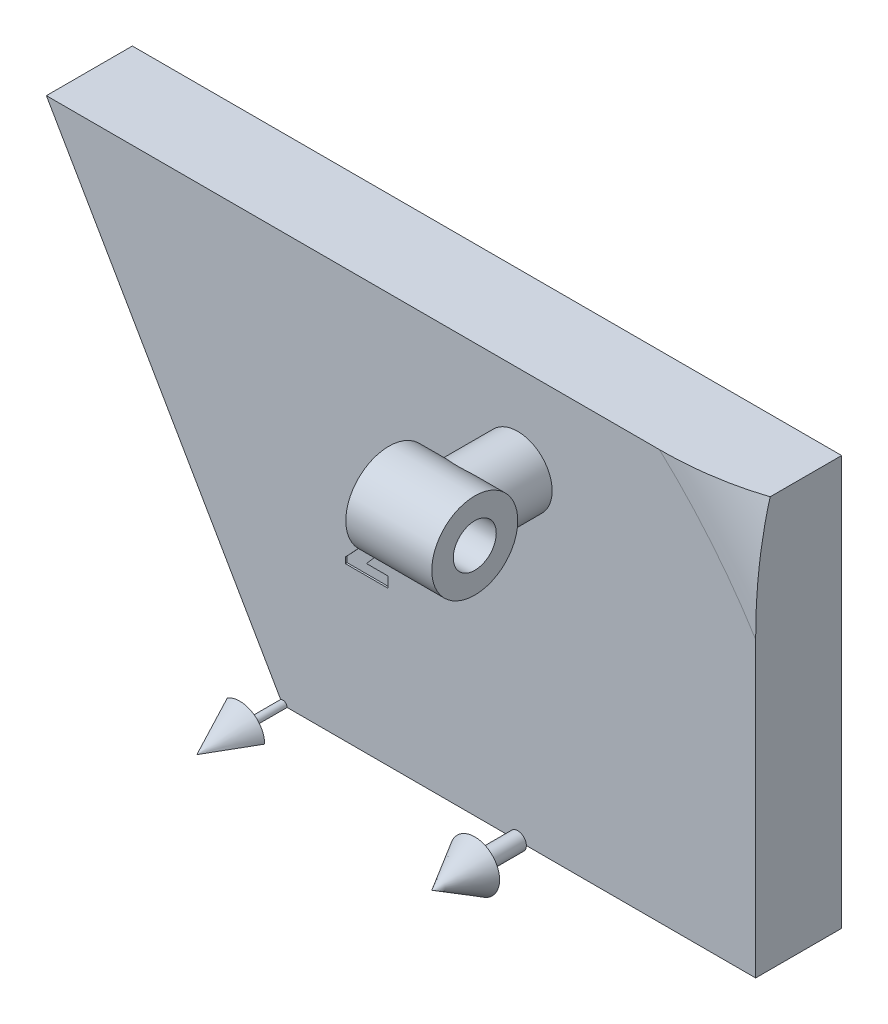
ISO-10303-21;
HEADER;
FILE_DESCRIPTION(('STEP AP214'),'2;1');
FILE_NAME('part.step','',(''),(''),'','','');
FILE_SCHEMA(('AUTOMOTIVE_DESIGN { 1 0 10303 214 1 1 1 1 }'));
ENDSEC;
DATA;
#1=APPLICATION_CONTEXT('core data for automotive mechanical design processes');
#2=APPLICATION_PROTOCOL_DEFINITION('international standard','automotive_design',2000,#1);
#3=PRODUCT_CONTEXT('',#1,'mechanical');
#4=PRODUCT('Part','Part','',(#3));
#5=PRODUCT_RELATED_PRODUCT_CATEGORY('part','',(#4));
#6=PRODUCT_DEFINITION_FORMATION('','',#4);
#7=PRODUCT_DEFINITION_CONTEXT('part definition',#1,'design');
#8=PRODUCT_DEFINITION('design','',#6,#7);
#9=PRODUCT_DEFINITION_SHAPE('','',#8);
#10=(LENGTH_UNIT() NAMED_UNIT(*) SI_UNIT(.MILLI.,.METRE.));
#11=(NAMED_UNIT(*) PLANE_ANGLE_UNIT() SI_UNIT($,.RADIAN.));
#12=(NAMED_UNIT(*) SI_UNIT($,.STERADIAN.) SOLID_ANGLE_UNIT());
#13=UNCERTAINTY_MEASURE_WITH_UNIT(LENGTH_MEASURE(1.E-05),#10,'distance_accuracy_value','');
#14=(GEOMETRIC_REPRESENTATION_CONTEXT(3) GLOBAL_UNCERTAINTY_ASSIGNED_CONTEXT((#13)) GLOBAL_UNIT_ASSIGNED_CONTEXT((#10,
#11,#12)) REPRESENTATION_CONTEXT('',''));
#15=CARTESIAN_POINT('',(0.,0.,0.));
#16=DIRECTION('',(0.,0.,1.));
#17=DIRECTION('',(1.,0.,0.));
#18=AXIS2_PLACEMENT_3D('',#15,#16,#17);
#19=CARTESIAN_POINT('',(55.,0.,10.));
#20=DIRECTION('',(0.,0.,-1.));
#21=DIRECTION('',(-1.,0.,0.));
#22=AXIS2_PLACEMENT_3D('',#19,#20,#21);
#23=PLANE('',#22);
#24=CARTESIAN_POINT('',(27.33,37.23,9.99999999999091));
#25=DIRECTION('',(0.,0.,-1.));
#26=DIRECTION('',(-1.,0.,0.));
#27=AXIS2_PLACEMENT_3D('',#24,#25,#26);
#28=CIRCLE('',#27,4.00000000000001);
#29=CARTESIAN_POINT('',(23.33,37.23,9.99999999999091));
#30=VERTEX_POINT('',#29);
#31=EDGE_CURVE('E50',#30,#30,#28,.F.);
#32=ORIENTED_EDGE('',*,*,#31,.F.);
#33=EDGE_LOOP('',(#32));
#34=FACE_BOUND('',#33,.T.);
#35=DIRECTION('',(0.,1.,0.));
#36=VECTOR('',#35,1.);
#37=CARTESIAN_POINT('',(55.,47.631397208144,10.));
#38=LINE('',#37,#36);
#39=CARTESIAN_POINT('',(55.,0.,10.));
#40=VERTEX_POINT('',#39);
#41=CARTESIAN_POINT('',(55.,34.1046264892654,10.));
#42=VERTEX_POINT('',#41);
#43=EDGE_CURVE('E204',#40,#42,#38,.T.);
#44=ORIENTED_EDGE('',*,*,#43,.T.);
#45=CARTESIAN_POINT('',(0.,0.,10.));
#46=DIRECTION('',(0.,0.,-1.));
#47=DIRECTION('',(-1.,0.,0.));
#48=AXIS2_PLACEMENT_3D('',#45,#46,#47);
#49=CIRCLE('',#48,64.7157287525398);
#50=CARTESIAN_POINT('',(43.8106784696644,47.631397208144,10.));
#51=VERTEX_POINT('',#50);
#52=EDGE_CURVE('E194',#51,#42,#49,.T.);
#53=ORIENTED_EDGE('',*,*,#52,.F.);
#54=DIRECTION('',(-1.,0.,0.));
#55=VECTOR('',#54,1.);
#56=CARTESIAN_POINT('',(-27.5000000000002,47.631397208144,10.));
#57=LINE('',#56,#55);
#58=CARTESIAN_POINT('',(-27.5000000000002,47.631397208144,10.));
#59=VERTEX_POINT('',#58);
#60=EDGE_CURVE('E201',#51,#59,#57,.T.);
#61=ORIENTED_EDGE('',*,*,#60,.T.);
#62=DIRECTION('',(0.500000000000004,-0.866025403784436,0.));
#63=VECTOR('',#62,1.);
#64=CARTESIAN_POINT('',(-27.5000000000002,47.631397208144,10.));
#65=LINE('',#64,#63);
#66=CARTESIAN_POINT('',(-0.25,0.433012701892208,10.));
#67=VERTEX_POINT('',#66);
#68=EDGE_CURVE('E210',#59,#67,#65,.T.);
#69=ORIENTED_EDGE('',*,*,#68,.T.);
#70=CARTESIAN_POINT('',(0.,0.,10.));
#71=DIRECTION('',(0.,0.,-1.));
#72=DIRECTION('',(-1.,0.,0.));
#73=AXIS2_PLACEMENT_3D('',#70,#71,#72);
#74=CIRCLE('',#73,0.5);
#75=CARTESIAN_POINT('',(0.5,0.,10.));
#76=VERTEX_POINT('',#75);
#77=EDGE_CURVE('E425',#67,#76,#74,.T.);
#78=ORIENTED_EDGE('',*,*,#77,.T.);
#79=DIRECTION('',(1.,0.,0.));
#80=VECTOR('',#79,1.);
#81=CARTESIAN_POINT('',(0.,0.,10.));
#82=LINE('',#81,#80);
#83=CARTESIAN_POINT('',(26.33,0.,10.));
#84=VERTEX_POINT('',#83);
#85=EDGE_CURVE('E214',#76,#84,#82,.T.);
#86=ORIENTED_EDGE('',*,*,#85,.T.);
#87=CARTESIAN_POINT('',(27.33,0.,10.));
#88=DIRECTION('',(0.,0.,-1.));
#89=DIRECTION('',(0.,1.,0.));
#90=AXIS2_PLACEMENT_3D('',#87,#88,#89);
#91=CIRCLE('',#90,1.);
#92=CARTESIAN_POINT('',(28.33,0.,10.));
#93=VERTEX_POINT('',#92);
#94=EDGE_CURVE('E403',#84,#93,#91,.T.);
#95=ORIENTED_EDGE('',*,*,#94,.T.);
#96=EDGE_CURVE('E229',#93,#40,#82,.T.);
#97=ORIENTED_EDGE('',*,*,#96,.T.);
#98=EDGE_LOOP('',(#44,#53,#61,#69,#78,#86,#95,#97));
#99=FACE_BOUND('',#98,.T.);
#100=CARTESIAN_POINT('',(9.82463943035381,24.1470226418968,10.));
#101=CARTESIAN_POINT('',(9.78946170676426,24.1457784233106,10.));
#102=CARTESIAN_POINT('',(9.72020870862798,24.1433289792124,10.));
#103=CARTESIAN_POINT('',(9.61841221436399,24.1270236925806,10.));
#104=CARTESIAN_POINT('',(9.52154553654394,24.0982873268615,10.));
#105=CARTESIAN_POINT('',(9.42853049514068,24.0597846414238,10.));
#106=CARTESIAN_POINT('',(9.34035977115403,24.0087490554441,10.));
#107=CARTESIAN_POINT('',(9.25725575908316,23.9458395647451,10.));
#108=CARTESIAN_POINT('',(9.17834285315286,23.8726548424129,10.));
#109=CARTESIAN_POINT('',(9.1039829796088,23.7894237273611,10.));
#110=CARTESIAN_POINT('',(9.0363057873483,23.6965377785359,10.));
#111=CARTESIAN_POINT('',(8.97619515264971,23.5948453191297,10.));
#112=CARTESIAN_POINT('',(8.92649366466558,23.4844094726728,10.));
#113=CARTESIAN_POINT('',(8.88273466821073,23.3666881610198,10.));
#114=CARTESIAN_POINT('',(8.84898563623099,23.2404169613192,10.));
#115=CARTESIAN_POINT('',(8.82441215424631,23.1063515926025,10.));
#116=CARTESIAN_POINT('',(8.80573057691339,22.9647101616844,10.));
#117=CARTESIAN_POINT('',(8.80139466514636,22.867344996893,10.));
#118=CARTESIAN_POINT('',(8.79916700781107,22.8173217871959,10.));
#119=B_SPLINE_CURVE_WITH_KNOTS('',3,(#100,#101,#102,#103,#104,#105,#106,#107,#108,#109,#110,
#111,#112,#113,#114,#115,#116,#117,#118),.UNSPECIFIED.,.F.,.F.,(4,1,1,1,1,1,1,1,1,1,1,1,1,1,1,1,
4),(0.,0.0564668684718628,0.111164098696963,0.164937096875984,0.218321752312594,
0.272392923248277,0.327976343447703,0.385291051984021,0.444902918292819,0.506843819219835,
0.569488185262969,0.634153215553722,0.700976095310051,0.770897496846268,0.843625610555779,
0.91965967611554,1.),.UNSPECIFIED.);
#120=CARTESIAN_POINT('',(9.82463943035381,24.1470226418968,10.));
#121=VERTEX_POINT('',#120);
#122=CARTESIAN_POINT('',(8.79916700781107,22.8173217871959,10.));
#123=VERTEX_POINT('',#122);
#124=EDGE_CURVE('E64',#121,#123,#119,.T.);
#125=ORIENTED_EDGE('',*,*,#124,.T.);
#126=DIRECTION('',(-1.,0.,0.));
#127=VECTOR('',#126,1.);
#128=CARTESIAN_POINT('',(8.79916700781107,22.8173217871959,10.));
#129=LINE('',#128,#127);
#130=CARTESIAN_POINT('',(7.46946615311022,22.8173217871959,10.));
#131=VERTEX_POINT('',#130);
#132=EDGE_CURVE('E308',#123,#131,#129,.T.);
#133=ORIENTED_EDGE('',*,*,#132,.T.);
#134=CARTESIAN_POINT('',(7.46946615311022,22.8173217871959,10.));
#135=CARTESIAN_POINT('',(7.47520892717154,22.9179066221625,10.));
#136=CARTESIAN_POINT('',(7.48642996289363,23.1144433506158,10.));
#137=CARTESIAN_POINT('',(7.53106440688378,23.3999192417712,10.));
#138=CARTESIAN_POINT('',(7.59087303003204,23.6696625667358,10.));
#139=CARTESIAN_POINT('',(7.6706955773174,23.9227297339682,10.));
#140=CARTESIAN_POINT('',(7.77099783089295,24.1590287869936,10.));
#141=CARTESIAN_POINT('',(7.88919875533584,24.3793652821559,10.));
#142=CARTESIAN_POINT('',(8.02831811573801,24.5825791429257,10.));
#143=CARTESIAN_POINT('',(8.18539499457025,24.7676903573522,10.));
#144=CARTESIAN_POINT('',(8.35776265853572,24.9337553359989,10.));
#145=CARTESIAN_POINT('',(8.54184258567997,25.0809989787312,10.));
#146=CARTESIAN_POINT('',(8.74045052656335,25.2025007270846,10.));
#147=CARTESIAN_POINT('',(8.9499577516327,25.3024854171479,10.));
#148=CARTESIAN_POINT('',(9.17032858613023,25.3823685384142,10.));
#149=CARTESIAN_POINT('',(9.40364808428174,25.4357768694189,10.));
#150=CARTESIAN_POINT('',(9.64789603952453,25.4719455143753,10.));
#151=CARTESIAN_POINT('',(9.81510354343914,25.4751104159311,10.));
#152=CARTESIAN_POINT('',(9.90032552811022,25.4767234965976,10.));
#153=B_SPLINE_CURVE_WITH_KNOTS('',3,(#134,#135,#136,#137,#138,#139,#140,#141,#142,#143,#144,
#145,#146,#147,#148,#149,#150,#151,#152),.UNSPECIFIED.,.F.,.F.,(4,1,1,1,1,1,1,1,1,1,1,1,1,1,1,1,
4),(0.,0.0749399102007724,0.146428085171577,0.214752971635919,0.280421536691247,
0.343604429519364,0.405542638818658,0.466199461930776,0.526538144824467,0.585901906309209,
0.644089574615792,0.701613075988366,0.758753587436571,0.816629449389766,0.875655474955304,
0.936624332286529,1.),.UNSPECIFIED.);
#154=CARTESIAN_POINT('',(9.90032552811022,25.4767234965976,10.));
#155=VERTEX_POINT('',#154);
#156=EDGE_CURVE('E314',#131,#155,#153,.T.);
#157=ORIENTED_EDGE('',*,*,#156,.T.);
#158=CARTESIAN_POINT('',(9.90032552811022,25.4767234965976,10.));
#159=CARTESIAN_POINT('',(10.0049343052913,25.4734594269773,10.));
#160=CARTESIAN_POINT('',(10.2091551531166,25.467087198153,10.));
#161=CARTESIAN_POINT('',(10.5059042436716,25.4127299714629,10.));
#162=CARTESIAN_POINT('',(10.7830354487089,25.32180910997,10.));
#163=CARTESIAN_POINT('',(11.040347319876,25.194768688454,10.));
#164=CARTESIAN_POINT('',(11.2756493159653,25.0333771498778,10.));
#165=CARTESIAN_POINT('',(11.4889024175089,24.8409441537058,10.));
#166=CARTESIAN_POINT('',(11.6736575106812,24.6134323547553,10.));
#167=CARTESIAN_POINT('',(11.8310859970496,24.3603081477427,10.));
#168=CARTESIAN_POINT('',(11.9618902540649,24.0922852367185,10.));
#169=CARTESIAN_POINT('',(12.0535524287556,23.81513843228,10.));
#170=CARTESIAN_POINT('',(12.1138009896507,23.5362220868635,10.));
#171=CARTESIAN_POINT('',(12.1202268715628,23.3484139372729,10.));
#172=CARTESIAN_POINT('',(12.1234191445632,23.2551139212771,10.));
#173=B_SPLINE_CURVE_WITH_KNOTS('',3,(#158,#159,#160,#161,#162,#163,#164,#165,#166,#167,#168,
#169,#170,#171,#172),.UNSPECIFIED.,.F.,.F.,(4,1,1,1,1,1,1,1,1,1,1,1,4),(0.,0.0896145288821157,
0.174948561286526,0.257548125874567,0.338900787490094,0.420053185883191,0.501401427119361,
0.584252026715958,0.670370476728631,0.756473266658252,0.839206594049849,0.920120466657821,1.),.UNSPECIFIED.);
#174=CARTESIAN_POINT('',(12.1234191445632,23.2551139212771,10.));
#175=VERTEX_POINT('',#174);
#176=EDGE_CURVE('E319',#155,#175,#173,.T.);
#177=ORIENTED_EDGE('',*,*,#176,.T.);
#178=CARTESIAN_POINT('',(12.1234191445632,23.2551139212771,10.));
#179=CARTESIAN_POINT('',(12.1221762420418,23.1986794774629,10.));
#180=CARTESIAN_POINT('',(12.1196745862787,23.0850908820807,10.));
#181=CARTESIAN_POINT('',(12.1022802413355,22.9132034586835,10.));
#182=CARTESIAN_POINT('',(12.0761852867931,22.7381160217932,9.99999999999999));
#183=CARTESIAN_POINT('',(12.0368404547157,22.5599786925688,10.));
#184=CARTESIAN_POINT('',(11.9877742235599,22.3787415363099,10.));
#185=CARTESIAN_POINT('',(11.9282497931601,22.1938621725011,10.));
#186=CARTESIAN_POINT('',(11.8568864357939,22.0063887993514,10.));
#187=CARTESIAN_POINT('',(11.7748750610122,21.8142114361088,10.));
#188=CARTESIAN_POINT('',(11.677035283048,21.6167061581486,10.));
#189=CARTESIAN_POINT('',(11.5631144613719,21.4109122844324,10.));
#190=CARTESIAN_POINT('',(11.4300888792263,21.1970123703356,10.));
#191=CARTESIAN_POINT('',(11.2795653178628,20.9737986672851,10.));
#192=CARTESIAN_POINT('',(11.1108127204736,20.7416232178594,10.));
#193=CARTESIAN_POINT('',(10.9230072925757,20.5011854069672,10.));
#194=CARTESIAN_POINT('',(10.7183121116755,20.2516380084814,10.));
#195=CARTESIAN_POINT('',(10.5730341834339,20.0848295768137,10.));
#196=CARTESIAN_POINT('',(10.4983941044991,19.999127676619,10.));
#197=B_SPLINE_CURVE_WITH_KNOTS('',3,(#178,#179,#180,#181,#182,#183,#184,#185,#186,#187,#188,
#189,#190,#191,#192,#193,#194,#195,#196),.UNSPECIFIED.,.F.,.F.,(4,1,1,1,1,1,1,1,1,1,1,1,1,1,1,1,
4),(0.,0.0455177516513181,0.0916159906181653,0.139246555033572,0.188241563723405,
0.238673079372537,0.290663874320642,0.344839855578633,0.400431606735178,0.459143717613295,
0.522551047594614,0.590100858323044,0.662259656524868,0.739681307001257,0.821575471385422,
0.908330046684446,1.),.UNSPECIFIED.);
#198=CARTESIAN_POINT('',(10.4983941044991,19.999127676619,10.));
#199=VERTEX_POINT('',#198);
#200=EDGE_CURVE('E327',#175,#199,#197,.T.);
#201=ORIENTED_EDGE('',*,*,#200,.T.);
#202=DIRECTION('',(-0.657521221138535,-0.753436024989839,0.));
#203=VECTOR('',#202,1.);
#204=CARTESIAN_POINT('',(10.4983941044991,19.999127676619,10.));
#205=LINE('',#204,#203);
#206=CARTESIAN_POINT('',(9.72520867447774,19.1131551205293,10.));
#207=VERTEX_POINT('',#206);
#208=EDGE_CURVE('E335',#199,#207,#205,.T.);
#209=ORIENTED_EDGE('',*,*,#208,.T.);
#210=DIRECTION('',(1.,0.,0.));
#211=VECTOR('',#210,1.);
#212=CARTESIAN_POINT('',(9.72520867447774,19.1131551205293,10.));
#213=LINE('',#212,#211);
#214=CARTESIAN_POINT('',(12.2183977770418,19.1131551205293,10.));
#215=VERTEX_POINT('',#214);
#216=EDGE_CURVE('E341',#207,#215,#213,.T.);
#217=ORIENTED_EDGE('',*,*,#216,.T.);
#218=DIRECTION('',(0.,-1.,0.));
#219=VECTOR('',#218,1.);
#220=CARTESIAN_POINT('',(12.2183977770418,19.1131551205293,10.));
#221=LINE('',#220,#219);
#222=CARTESIAN_POINT('',(12.2183977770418,17.878432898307,10.));
#223=VERTEX_POINT('',#222);
#224=EDGE_CURVE('E344',#215,#223,#221,.T.);
#225=ORIENTED_EDGE('',*,*,#224,.T.);
#226=DIRECTION('',(-1.,0.,0.));
#227=VECTOR('',#226,1.);
#228=CARTESIAN_POINT('',(12.2183977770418,17.878432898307,10.));
#229=LINE('',#228,#227);
#230=CARTESIAN_POINT('',(7.27950888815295,17.878432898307,10.));
#231=VERTEX_POINT('',#230);
#232=EDGE_CURVE('E347',#223,#231,#229,.T.);
#233=ORIENTED_EDGE('',*,*,#232,.T.);
#234=DIRECTION('',(0.,1.,0.));
#235=VECTOR('',#234,1.);
#236=CARTESIAN_POINT('',(7.27950888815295,17.878432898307,10.));
#237=LINE('',#236,#235);
#238=CARTESIAN_POINT('',(7.27950888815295,18.5521875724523,10.));
#239=VERTEX_POINT('',#238);
#240=EDGE_CURVE('E350',#231,#239,#237,.T.);
#241=ORIENTED_EDGE('',*,*,#240,.T.);
#242=DIRECTION('',(0.684757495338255,0.728771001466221,0.));
#243=VECTOR('',#242,1.);
#244=CARTESIAN_POINT('',(7.27950888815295,18.5521875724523,10.));
#245=LINE('',#244,#243);
#246=CARTESIAN_POINT('',(9.47292168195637,20.8865842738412,10.));
#247=VERTEX_POINT('',#246);
#248=EDGE_CURVE('E353',#239,#247,#245,.T.);
#249=ORIENTED_EDGE('',*,*,#248,.T.);
#250=CARTESIAN_POINT('',(9.47292168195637,20.8865842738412,10.));
#251=CARTESIAN_POINT('',(9.53642661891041,20.9546793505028,10.));
#252=CARTESIAN_POINT('',(9.65941684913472,21.0865593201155,10.));
#253=CARTESIAN_POINT('',(9.83441927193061,21.2802390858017,10.));
#254=CARTESIAN_POINT('',(9.99278100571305,21.4640365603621,10.));
#255=CARTESIAN_POINT('',(10.1312182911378,21.6399088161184,10.));
#256=CARTESIAN_POINT('',(10.2569961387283,21.8021512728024,10.));
#257=CARTESIAN_POINT('',(10.3645061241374,21.9556541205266,10.));
#258=CARTESIAN_POINT('',(10.4547318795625,22.0990296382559,10.));
#259=CARTESIAN_POINT('',(10.5526847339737,22.2719154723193,10.));
#260=CARTESIAN_POINT('',(10.6457077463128,22.4781125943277,10.));
#261=CARTESIAN_POINT('',(10.7310619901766,22.7156601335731,10.));
#262=CARTESIAN_POINT('',(10.7830913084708,22.9427008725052,10.));
#263=CARTESIAN_POINT('',(10.7902729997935,23.090645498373,10.));
#264=CARTESIAN_POINT('',(10.7937182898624,23.161619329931,10.));
#265=B_SPLINE_CURVE_WITH_KNOTS('',3,(#250,#251,#252,#253,#254,#255,#256,#257,#258,#259,#260,
#261,#262,#263,#264),.UNSPECIFIED.,.F.,.F.,(4,1,1,1,1,1,1,1,1,1,1,1,4),(0.,0.10384392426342,
0.201114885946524,0.291115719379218,0.374348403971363,0.450707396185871,0.520040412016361,
0.583258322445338,0.639578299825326,0.741536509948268,0.835060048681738,0.920872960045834,1.),.UNSPECIFIED.);
#266=CARTESIAN_POINT('',(10.7937182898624,23.161619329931,10.));
#267=VERTEX_POINT('',#266);
#268=EDGE_CURVE('E356',#247,#267,#265,.T.);
#269=ORIENTED_EDGE('',*,*,#268,.T.);
#270=CARTESIAN_POINT('',(10.7937182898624,23.161619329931,10.));
#271=CARTESIAN_POINT('',(10.7911423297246,23.2302810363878,10.));
#272=CARTESIAN_POINT('',(10.7861509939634,23.3633241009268,10.));
#273=CARTESIAN_POINT('',(10.7313002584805,23.552577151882,10.));
#274=CARTESIAN_POINT('',(10.6463235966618,23.7239264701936,10.));
#275=CARTESIAN_POINT('',(10.5265794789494,23.8722519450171,10.));
#276=CARTESIAN_POINT('',(10.3815318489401,23.9941408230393,10.));
#277=CARTESIAN_POINT('',(10.2139156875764,24.0847983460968,10.));
#278=CARTESIAN_POINT('',(10.0250975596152,24.1371073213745,10.));
#279=CARTESIAN_POINT('',(9.89273245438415,24.1436545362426,10.));
#280=CARTESIAN_POINT('',(9.82463943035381,24.1470226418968,10.));
#281=B_SPLINE_CURVE_WITH_KNOTS('',3,(#270,#271,#272,#273,#274,#275,#276,#277,#278,#279,#280),
.UNSPECIFIED.,.F.,.F.,(4,1,1,1,1,1,1,1,4),(0.,0.132754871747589,0.257233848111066,
0.378600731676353,0.501406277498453,0.623941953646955,0.743641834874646,0.868120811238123,1.),.UNSPECIFIED.);
#282=EDGE_CURVE('E361',#267,#121,#281,.T.);
#283=ORIENTED_EDGE('',*,*,#282,.T.);
#284=EDGE_LOOP('',(#125,#133,#157,#177,#201,#209,#217,#225,#233,#241,#249,#269,#283));
#285=FACE_BOUND('',#284,.T.);
#286=ADVANCED_FACE('F38',(#34,#99,#285),#23,.F.);
#287=CARTESIAN_POINT('',(0.,0.,10.));
#288=DIRECTION('',(0.,1.,0.));
#289=DIRECTION('',(0.,0.,1.));
#290=AXIS2_PLACEMENT_3D('',#287,#288,#289);
#291=PLANE('',#290);
#292=DIRECTION('',(1.,0.,0.));
#293=VECTOR('',#292,1.);
#294=CARTESIAN_POINT('',(0.,0.,0.));
#295=LINE('',#294,#293);
#296=CARTESIAN_POINT('',(0.,0.,0.));
#297=VERTEX_POINT('',#296);
#298=CARTESIAN_POINT('',(55.,0.,0.));
#299=VERTEX_POINT('',#298);
#300=EDGE_CURVE('E218',#297,#299,#295,.T.);
#301=ORIENTED_EDGE('',*,*,#300,.T.);
#302=DIRECTION('',(0.,0.,-1.));
#303=VECTOR('',#302,1.);
#304=CARTESIAN_POINT('',(55.,0.,10.));
#305=LINE('',#304,#303);
#306=EDGE_CURVE('E235',#40,#299,#305,.T.);
#307=ORIENTED_EDGE('',*,*,#306,.F.);
#308=ORIENTED_EDGE('',*,*,#96,.F.);
#309=EDGE_CURVE('E818',#84,#93,#82,.T.);
#310=ORIENTED_EDGE('',*,*,#309,.F.);
#311=ORIENTED_EDGE('',*,*,#85,.F.);
#312=DIRECTION('',(0.,0.,1.));
#313=VECTOR('',#312,1.);
#314=CARTESIAN_POINT('',(0.5,0.,10.));
#315=LINE('',#314,#313);
#316=CARTESIAN_POINT('',(0.5,0.,15.));
#317=VERTEX_POINT('',#316);
#318=EDGE_CURVE('E407',#76,#317,#315,.T.);
#319=ORIENTED_EDGE('',*,*,#318,.T.);
#320=DIRECTION('',(1.,0.,0.));
#321=VECTOR('',#320,1.);
#322=CARTESIAN_POINT('',(0.5,0.,15.));
#323=LINE('',#322,#321);
#324=CARTESIAN_POINT('',(2.88675134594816,0.,15.));
#325=VERTEX_POINT('',#324);
#326=EDGE_CURVE('E410',#317,#325,#323,.T.);
#327=ORIENTED_EDGE('',*,*,#326,.T.);
#328=DIRECTION('',(-0.500000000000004,0.,0.866025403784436));
#329=VECTOR('',#328,1.);
#330=CARTESIAN_POINT('',(2.88675134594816,0.,15.));
#331=LINE('',#330,#329);
#332=CARTESIAN_POINT('',(0.,0.,20.));
#333=VERTEX_POINT('',#332);
#334=EDGE_CURVE('E413',#325,#333,#331,.T.);
#335=ORIENTED_EDGE('',*,*,#334,.T.);
#336=DIRECTION('',(0.,0.,-1.));
#337=VECTOR('',#336,1.);
#338=CARTESIAN_POINT('',(0.,0.,10.));
#339=LINE('',#338,#337);
#340=EDGE_CURVE('E212',#333,#297,#339,.T.);
#341=ORIENTED_EDGE('',*,*,#340,.T.);
#342=EDGE_LOOP('',(#301,#307,#308,#310,#311,#319,#327,#335,#341));
#343=FACE_BOUND('',#342,.T.);
#344=ADVANCED_FACE('F40',(#343),#291,.F.);
#345=CARTESIAN_POINT('',(55.,47.631397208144,10.));
#346=DIRECTION('',(-1.,0.,0.));
#347=DIRECTION('',(0.,-1.,0.));
#348=AXIS2_PLACEMENT_3D('',#345,#346,#347);
#349=PLANE('',#348);
#350=DIRECTION('',(0.,0.,-1.));
#351=VECTOR('',#350,1.);
#352=CARTESIAN_POINT('',(55.,47.631397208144,10.));
#353=LINE('',#352,#351);
#354=CARTESIAN_POINT('',(55.,47.631397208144,8.3117252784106));
#355=VERTEX_POINT('',#354);
#356=CARTESIAN_POINT('',(55.,47.631397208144,0.));
#357=VERTEX_POINT('',#356);
#358=EDGE_CURVE('E233',#355,#357,#353,.T.);
#359=ORIENTED_EDGE('',*,*,#358,.F.);
#360=CARTESIAN_POINT('',(54.9999999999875,23.5563264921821,9.39463403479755));
#361=CARTESIAN_POINT('',(54.9999999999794,21.8487438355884,9.22535587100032));
#362=CARTESIAN_POINT('',(54.9999999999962,20.1433436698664,9.03467150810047));
#363=CARTESIAN_POINT('',(55.0000000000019,17.5855516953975,8.74525509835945));
#364=CARTESIAN_POINT('',(55.0000000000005,16.7329235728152,8.64820846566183));
#365=CARTESIAN_POINT('',(54.9999999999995,15.0272658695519,8.45772977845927));
#366=CARTESIAN_POINT('',(54.9999999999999,14.1742362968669,8.36429765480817));
#367=CARTESIAN_POINT('',(55.0000000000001,12.4690306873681,8.18583024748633));
#368=CARTESIAN_POINT('',(55.,11.616856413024,8.10077836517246));
#369=CARTESIAN_POINT('',(55.,9.91133671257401,7.94314996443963));
#370=CARTESIAN_POINT('',(55.,9.05799128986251,7.87057340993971));
#371=CARTESIAN_POINT('',(55.,7.35026571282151,7.74171582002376));
#372=CARTESIAN_POINT('',(55.,6.4958858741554,7.68543067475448));
#373=CARTESIAN_POINT('',(55.,4.78605820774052,7.59219713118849));
#374=CARTESIAN_POINT('',(55.,3.93061038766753,7.55524859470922));
#375=CARTESIAN_POINT('',(55.,2.22081761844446,7.50281946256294));
#376=CARTESIAN_POINT('',(55.,1.36647405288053,7.48729457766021));
#377=CARTESIAN_POINT('',(55.,-0.342329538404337,7.4784560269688));
#378=CARTESIAN_POINT('',(55.,-1.19678956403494,7.48514234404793));
#379=CARTESIAN_POINT('',(55.,-2.90535751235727,7.52034538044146));
#380=CARTESIAN_POINT('',(55.,-3.759465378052,7.54886481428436));
#381=CARTESIAN_POINT('',(55.,-5.46675395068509,7.62612469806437));
#382=CARTESIAN_POINT('',(55.,-6.31993465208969,7.6748652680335));
#383=CARTESIAN_POINT('',(55.,-8.02693072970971,7.79001009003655));
#384=CARTESIAN_POINT('',(55.,-8.88074350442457,7.85645222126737));
#385=CARTESIAN_POINT('',(55.,-10.5871401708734,8.00341417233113));
#386=CARTESIAN_POINT('',(55.,-11.4397240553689,8.08393407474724));
#387=CARTESIAN_POINT('',(55.,-13.1439113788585,8.25493171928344));
#388=CARTESIAN_POINT('',(55.,-13.9955147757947,8.34540987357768));
#389=CARTESIAN_POINT('',(55.,-15.6981240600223,8.53184066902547));
#390=CARTESIAN_POINT('',(55.,-16.5491299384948,8.62779338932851));
#391=CARTESIAN_POINT('',(55.,-18.1156761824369,8.80517336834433));
#392=CARTESIAN_POINT('',(55.,-18.8312297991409,8.88648303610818));
#393=CARTESIAN_POINT('',(55.,-20.2625517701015,9.0468447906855));
#394=CARTESIAN_POINT('',(55.,-20.9783201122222,9.12589698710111));
#395=CARTESIAN_POINT('',(55.,-23.1255591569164,9.35532781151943));
#396=CARTESIAN_POINT('',(55.,-24.5578876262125,9.49809267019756));
#397=CARTESIAN_POINT('',(55.,-27.428704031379,9.74088084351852));
#398=CARTESIAN_POINT('',(55.,-28.867198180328,9.84083471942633));
#399=CARTESIAN_POINT('',(55.,-31.7477063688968,9.97478416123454));
#400=CARTESIAN_POINT('',(55.,-33.1897205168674,10.0087776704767));
#401=CARTESIAN_POINT('',(55.,-35.83959983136,9.98906303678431));
#402=CARTESIAN_POINT('',(55.,-37.047521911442,9.9486806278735));
#403=CARTESIAN_POINT('',(55.,-39.4582060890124,9.79079948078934));
#404=CARTESIAN_POINT('',(55.,-40.6609699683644,9.67332997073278));
#405=CARTESIAN_POINT('',(55.,-43.0526425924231,9.3466379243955));
#406=CARTESIAN_POINT('',(55.,-44.24156800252,9.13754079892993));
#407=CARTESIAN_POINT('',(55.,-46.5954725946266,8.61232986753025));
#408=CARTESIAN_POINT('',(55.,-47.7604687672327,8.29629498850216));
#409=CARTESIAN_POINT('',(55.,-49.5576517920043,7.70432037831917));
#410=CARTESIAN_POINT('',(55.,-50.2035218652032,7.46958297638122));
#411=CARTESIAN_POINT('',(55.,-51.4783096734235,6.95769376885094));
#412=CARTESIAN_POINT('',(55.,-52.1072284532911,6.68054458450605));
#413=CARTESIAN_POINT('',(55.,-53.3429656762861,6.08151417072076));
#414=CARTESIAN_POINT('',(55.,-53.9498015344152,5.75966919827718));
#415=CARTESIAN_POINT('',(55.,-54.8394134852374,5.24179437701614));
#416=CARTESIAN_POINT('',(55.,-55.1324999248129,5.06332553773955));
#417=CARTESIAN_POINT('',(55.,-55.7111397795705,4.69439988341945));
#418=CARTESIAN_POINT('',(55.,-55.9966912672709,4.50394004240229));
#419=CARTESIAN_POINT('',(55.,-56.7458028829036,3.9806368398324));
#420=CARTESIAN_POINT('',(55.,-57.2019507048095,3.63706538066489));
#421=CARTESIAN_POINT('',(55.,-58.0865212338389,2.91602901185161));
#422=CARTESIAN_POINT('',(55.,-58.5149495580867,2.5385710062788));
#423=CARTESIAN_POINT('',(55.,-59.3392697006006,1.75003517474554));
#424=CARTESIAN_POINT('',(55.,-59.7351816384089,1.33897845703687));
#425=CARTESIAN_POINT('',(55.,-60.4896649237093,0.483889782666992));
#426=CARTESIAN_POINT('',(55.,-60.8482429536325,0.0398637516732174));
#427=CARTESIAN_POINT('',(55.,-61.4640638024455,-0.799406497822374));
#428=CARTESIAN_POINT('',(55.,-61.7280810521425,-1.18968826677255));
#429=CARTESIAN_POINT('',(55.,-62.2240503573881,-1.99008675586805));
#430=CARTESIAN_POINT('',(55.,-62.4560086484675,-2.40019959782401));
#431=CARTESIAN_POINT('',(55.,-62.8849347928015,-3.2382435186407));
#432=CARTESIAN_POINT('',(55.,-63.0819113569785,-3.66617012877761));
#433=CARTESIAN_POINT('',(55.,-63.438245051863,-4.53745890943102));
#434=CARTESIAN_POINT('',(55.,-63.5976015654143,-4.9808213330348));
#435=CARTESIAN_POINT('',(55.,-63.8770183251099,-5.8822093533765));
#436=CARTESIAN_POINT('',(55.,-63.9968796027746,-6.34029680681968));
#437=CARTESIAN_POINT('',(55.,-64.1943072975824,-7.26552590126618));
#438=CARTESIAN_POINT('',(55.,-64.2718733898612,-7.73266761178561));
#439=CARTESIAN_POINT('',(55.,-64.3834079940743,-8.67203247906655));
#440=CARTESIAN_POINT('',(55.,-64.4173862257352,-9.14425447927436));
#441=CARTESIAN_POINT('',(55.,-64.4411934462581,-10.0897932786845));
#442=CARTESIAN_POINT('',(55.,-64.4310255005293,-10.5631099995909));
#443=CARTESIAN_POINT('',(55.,-64.3694555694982,-11.4667594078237));
#444=CARTESIAN_POINT('',(55.,-64.3216164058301,-11.8973395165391));
#445=CARTESIAN_POINT('',(55.,-64.1897957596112,-12.7528991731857));
#446=CARTESIAN_POINT('',(55.,-64.1058167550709,-13.1778791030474));
#447=CARTESIAN_POINT('',(55.,-63.9028777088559,-14.0193451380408));
#448=CARTESIAN_POINT('',(55.,-63.7839204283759,-14.4358319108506));
#449=CARTESIAN_POINT('',(55.,-63.5125821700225,-15.2577626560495));
#450=CARTESIAN_POINT('',(55.,-63.3601999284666,-15.6632062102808));
#451=CARTESIAN_POINT('',(55.,-63.0213408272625,-16.4668382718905));
#452=CARTESIAN_POINT('',(55.,-62.8343805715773,-16.8648225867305));
#453=CARTESIAN_POINT('',(55.,-62.4301863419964,-17.6450582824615));
#454=CARTESIAN_POINT('',(55.,-62.2129529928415,-18.027309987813));
#455=CARTESIAN_POINT('',(55.,-61.7505361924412,-18.7745734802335));
#456=CARTESIAN_POINT('',(55.,-61.5053480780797,-19.1395823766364));
#457=CARTESIAN_POINT('',(55.,-60.9894634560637,-19.8511359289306));
#458=CARTESIAN_POINT('',(55.,-60.7187621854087,-20.1976771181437));
#459=CARTESIAN_POINT('',(55.,-60.0492752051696,-20.9967301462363));
#460=CARTESIAN_POINT('',(55.,-59.6402904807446,-21.4407328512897));
#461=CARTESIAN_POINT('',(55.,-58.7849044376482,-22.2911043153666));
#462=CARTESIAN_POINT('',(55.,-58.3384924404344,-22.6974622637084));
#463=CARTESIAN_POINT('',(55.,-57.4131139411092,-23.4728837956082));
#464=CARTESIAN_POINT('',(55.,-56.9340910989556,-23.841879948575));
#465=CARTESIAN_POINT('',(55.,-55.9493632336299,-24.5421766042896));
#466=CARTESIAN_POINT('',(55.,-55.4436571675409,-24.873475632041));
#467=CARTESIAN_POINT('',(55.,-54.2127281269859,-25.6188761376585));
#468=CARTESIAN_POINT('',(55.,-53.4773890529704,-26.0163201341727));
#469=CARTESIAN_POINT('',(55.,-51.974565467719,-26.7448852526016));
#470=CARTESIAN_POINT('',(55.,-51.2070684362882,-27.0759802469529));
#471=CARTESIAN_POINT('',(55.,-49.6486079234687,-27.6762268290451));
#472=CARTESIAN_POINT('',(55.,-48.857650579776,-27.9453944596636));
#473=CARTESIAN_POINT('',(55.,-47.2588755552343,-28.4268159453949));
#474=CARTESIAN_POINT('',(55.,-46.4510589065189,-28.6390732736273));
#475=CARTESIAN_POINT('',(55.,-44.2710719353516,-29.1384265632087));
#476=CARTESIAN_POINT('',(55.,-42.8880666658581,-29.3785088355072));
#477=CARTESIAN_POINT('',(55.,-40.1062248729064,-29.7369014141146));
#478=CARTESIAN_POINT('',(55.,-38.7073758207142,-29.8551073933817));
#479=CARTESIAN_POINT('',(55.,-35.897926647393,-29.9930623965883));
#480=CARTESIAN_POINT('',(55.,-34.4873033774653,-30.0122916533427));
#481=CARTESIAN_POINT('',(55.,-31.6681762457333,-29.9733824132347));
#482=CARTESIAN_POINT('',(55.,-30.2596717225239,-29.9152781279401));
#483=CARTESIAN_POINT('',(55.,-27.2308291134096,-29.7302844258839));
#484=CARTESIAN_POINT('',(55.,-25.6110957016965,-29.5942209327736));
#485=CARTESIAN_POINT('',(55.,-22.3754967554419,-29.2807157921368));
#486=CARTESIAN_POINT('',(55.,-20.759632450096,-29.1032624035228));
#487=CARTESIAN_POINT('',(55.,-17.5282447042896,-28.7395517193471));
#488=CARTESIAN_POINT('',(55.,-15.9127216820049,-28.5532908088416));
#489=CARTESIAN_POINT('',(55.,-13.4875736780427,-28.291427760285));
#490=CARTESIAN_POINT('',(55.,-12.6789206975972,-28.2070652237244));
#491=CARTESIAN_POINT('',(55.,-11.0606602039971,-28.0479462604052));
#492=CARTESIAN_POINT('',(55.,-10.2510526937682,-27.9731898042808));
#493=CARTESIAN_POINT('',(55.,-8.63234310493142,-27.8368954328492));
#494=CARTESIAN_POINT('',(55.,-7.82324326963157,-27.7753313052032));
#495=CARTESIAN_POINT('',(55.,-6.20397286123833,-27.6681856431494));
#496=CARTESIAN_POINT('',(55.,-5.39380229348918,-27.6226040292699));
#497=CARTESIAN_POINT('',(55.,-3.77272883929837,-27.5496925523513));
#498=CARTESIAN_POINT('',(55.,-2.96182605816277,-27.522360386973));
#499=CARTESIAN_POINT('',(55.,-1.33959122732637,-27.4873318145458));
#500=CARTESIAN_POINT('',(55.,-0.528259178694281,-27.4796353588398));
#501=CARTESIAN_POINT('',(55.,1.09386169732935,-27.484274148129));
#502=CARTESIAN_POINT('',(55.,1.90465055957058,-27.4965974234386));
#503=CARTESIAN_POINT('',(55.,3.52569517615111,-27.5406185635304));
#504=CARTESIAN_POINT('',(55.,4.33595092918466,-27.5723164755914));
#505=CARTESIAN_POINT('',(55.,5.95568150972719,-27.653487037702));
#506=CARTESIAN_POINT('',(55.,6.76515619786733,-27.7029624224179));
#507=CARTESIAN_POINT('',(55.,8.38301111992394,-27.8172517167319));
#508=CARTESIAN_POINT('',(55.,9.19139134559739,-27.8820657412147));
#509=CARTESIAN_POINT('',(55.,10.6731085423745,-28.012184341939));
#510=CARTESIAN_POINT('',(55.,11.3466121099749,-28.0756256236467));
#511=CARTESIAN_POINT('',(55.,12.692975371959,-28.2089955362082));
#512=CARTESIAN_POINT('',(55.,13.365835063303,-28.2789241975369));
#513=CARTESIAN_POINT('',(55.,15.3836519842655,-28.4951891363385));
#514=CARTESIAN_POINT('',(55.,16.7279005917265,-28.6480094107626));
#515=CARTESIAN_POINT('',(55.,19.4191239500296,-28.9528707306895));
#516=CARTESIAN_POINT('',(55.,20.7660989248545,-29.1049096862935));
#517=CARTESIAN_POINT('',(55.,23.4621339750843,-29.3889925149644));
#518=CARTESIAN_POINT('',(55.,24.8111938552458,-29.521038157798));
#519=CARTESIAN_POINT('',(55.,27.5041898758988,-29.7455479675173));
#520=CARTESIAN_POINT('',(55.,28.8481044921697,-29.8382570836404));
#521=CARTESIAN_POINT('',(55.,31.5392036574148,-29.9666412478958));
#522=CARTESIAN_POINT('',(55.,32.8863888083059,-30.0023048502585));
#523=CARTESIAN_POINT('',(55.,35.5769251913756,-29.9974705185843));
#524=CARTESIAN_POINT('',(55.,36.9202758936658,-29.9571990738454));
#525=CARTESIAN_POINT('',(55.,39.6004228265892,-29.7812996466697));
#526=CARTESIAN_POINT('',(55.,40.93722305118,-29.6457397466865));
#527=CARTESIAN_POINT('',(55.,43.1311830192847,-29.3262739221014));
#528=CARTESIAN_POINT('',(55.,43.9931929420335,-29.1756639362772));
#529=CARTESIAN_POINT('',(55.,45.7062098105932,-28.8193723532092));
#530=CARTESIAN_POINT('',(55.,46.5572129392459,-28.6136721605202));
#531=CARTESIAN_POINT('',(55.,48.243686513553,-28.1409189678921));
#532=CARTESIAN_POINT('',(55.,49.0791317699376,-27.8737744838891));
#533=CARTESIAN_POINT('',(55.,50.3137066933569,-27.4230021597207));
#534=CARTESIAN_POINT('',(55.,50.7220795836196,-27.2644266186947));
#535=CARTESIAN_POINT('',(55.,51.5317450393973,-26.9298357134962));
#536=CARTESIAN_POINT('',(55.,51.93303595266,-26.7538163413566));
#537=CARTESIAN_POINT('',(55.,52.9179842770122,-26.2948117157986));
#538=CARTESIAN_POINT('',(55.,53.4966772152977,-26.0010508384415));
#539=CARTESIAN_POINT('',(55.,54.6310002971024,-25.3721240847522));
#540=CARTESIAN_POINT('',(55.,55.1866361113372,-25.0369684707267));
#541=CARTESIAN_POINT('',(55.,56.2689129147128,-24.324265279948));
#542=CARTESIAN_POINT('',(55.,56.795597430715,-23.9467840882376));
#543=CARTESIAN_POINT('',(55.,57.8148131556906,-23.1481876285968));
#544=CARTESIAN_POINT('',(55.,58.30735182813,-22.7270819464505));
#545=CARTESIAN_POINT('',(55.,59.1550097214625,-21.9318510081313));
#546=CARTESIAN_POINT('',(55.,59.5176388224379,-21.565717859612));
#547=CARTESIAN_POINT('',(55.,60.2133249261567,-20.8064067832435));
#548=CARTESIAN_POINT('',(55.,60.5463886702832,-20.4132350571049));
#549=CARTESIAN_POINT('',(55.,61.1791971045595,-19.6007904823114));
#550=CARTESIAN_POINT('',(55.,61.4789378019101,-19.181514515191));
#551=CARTESIAN_POINT('',(55.,62.0411333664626,-18.318585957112));
#552=CARTESIAN_POINT('',(55.,62.3035876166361,-17.8749329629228));
#553=CARTESIAN_POINT('',(55.,62.7892710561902,-16.9620448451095));
#554=CARTESIAN_POINT('',(55.,63.0121716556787,-16.4926343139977));
#555=CARTESIAN_POINT('',(55.,63.41248387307,-15.5347298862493));
#556=CARTESIAN_POINT('',(55.,63.5898946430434,-15.0462356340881));
#557=CARTESIAN_POINT('',(55.,63.8959263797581,-14.054513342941));
#558=CARTESIAN_POINT('',(55.,64.0245799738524,-13.5512954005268));
#559=CARTESIAN_POINT('',(55.,64.230775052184,-12.5345114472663));
#560=CARTESIAN_POINT('',(55.,64.3083242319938,-12.0209470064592));
#561=CARTESIAN_POINT('',(55.,64.4040188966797,-11.0568824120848));
#562=CARTESIAN_POINT('',(55.,64.4286599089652,-10.607016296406));
#563=CARTESIAN_POINT('',(55.,64.4379431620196,-9.706896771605));
#564=CARTESIAN_POINT('',(55.,64.4225895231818,-9.25664340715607));
#565=CARTESIAN_POINT('',(55.,64.3521329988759,-8.35938797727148));
#566=CARTESIAN_POINT('',(55.,64.2970402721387,-7.91238511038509));
#567=CARTESIAN_POINT('',(55.,64.1479562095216,-7.02492214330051));
#568=CARTESIAN_POINT('',(55.,64.0539647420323,-6.58446206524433));
#569=CARTESIAN_POINT('',(55.,63.8334725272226,-5.73258587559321));
#570=CARTESIAN_POINT('',(55.,63.7085959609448,-5.32074740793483));
#571=CARTESIAN_POINT('',(55.,63.4261960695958,-4.50846162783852));
#572=CARTESIAN_POINT('',(55.,63.2686742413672,-4.10801379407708));
#573=CARTESIAN_POINT('',(55.,62.9228674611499,-3.32061821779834));
#574=CARTESIAN_POINT('',(55.,62.7345798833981,-2.93367163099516));
#575=CARTESIAN_POINT('',(55.,62.3293577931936,-2.17509370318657));
#576=CARTESIAN_POINT('',(55.,62.1124216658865,-1.80346322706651));
#577=CARTESIAN_POINT('',(55.,61.6343403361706,-1.04886955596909));
#578=CARTESIAN_POINT('',(55.,61.3710740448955,-0.667250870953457));
#579=CARTESIAN_POINT('',(55.,60.8167548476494,0.0751887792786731));
#580=CARTESIAN_POINT('',(55.,60.5257013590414,0.436009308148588));
#581=CARTESIAN_POINT('',(55.,59.9185703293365,1.13603316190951));
#582=CARTESIAN_POINT('',(55.,59.6024877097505,1.47523207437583));
#583=CARTESIAN_POINT('',(55.,58.9480510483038,2.13146080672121));
#584=CARTESIAN_POINT('',(55.,58.6096923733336,2.44848598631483));
#585=CARTESIAN_POINT('',(55.,57.7429996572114,3.20970512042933));
#586=CARTESIAN_POINT('',(55.,57.2026591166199,3.64029956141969));
#587=CARTESIAN_POINT('',(55.,56.0861483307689,4.45225432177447));
#588=CARTESIAN_POINT('',(55.,55.5099644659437,4.83359575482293));
#589=CARTESIAN_POINT('',(55.,54.3274300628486,5.5491401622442));
#590=CARTESIAN_POINT('',(55.,53.7210166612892,5.88323884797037));
#591=CARTESIAN_POINT('',(55.,52.4851668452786,6.50535940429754));
#592=CARTESIAN_POINT('',(55.,51.855730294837,6.79338100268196));
#593=CARTESIAN_POINT('',(55.,50.272422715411,7.45362640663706));
#594=CARTESIAN_POINT('',(55.,49.3077324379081,7.79998469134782));
#595=CARTESIAN_POINT('',(55.,47.3514089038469,8.40643800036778));
#596=CARTESIAN_POINT('',(55.,46.359759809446,8.66648107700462));
#597=CARTESIAN_POINT('',(55.,44.8598570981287,8.99873538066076));
#598=CARTESIAN_POINT('',(55.,44.3577803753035,9.09985711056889));
#599=CARTESIAN_POINT('',(55.,43.3505352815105,9.28398623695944));
#600=CARTESIAN_POINT('',(55.,42.8453683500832,9.36700149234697));
#601=CARTESIAN_POINT('',(55.,41.3261421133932,9.59070961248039));
#602=CARTESIAN_POINT('',(55.,40.3083119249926,9.70607465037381));
#603=CARTESIAN_POINT('',(55.,37.9809879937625,9.90261113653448));
#604=CARTESIAN_POINT('',(54.9999999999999,36.6699705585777,9.96504194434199));
#605=CARTESIAN_POINT('',(55.0000000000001,34.0467818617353,10.0125471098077));
#606=CARTESIAN_POINT('',(55.0000000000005,32.7346104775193,9.99761190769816));
#607=CARTESIAN_POINT('',(54.9999999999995,30.1098070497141,9.90807890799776));
#608=CARTESIAN_POINT('',(54.9999999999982,28.7971797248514,9.83335707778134));
#609=CARTESIAN_POINT('',(55.0000000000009,26.8304628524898,9.68947744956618));
#610=CARTESIAN_POINT('',(55.0000000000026,26.1751167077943,9.63620280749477));
#611=CARTESIAN_POINT('',(54.9999999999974,24.865182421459,9.52121078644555));
#612=CARTESIAN_POINT('',(54.9999999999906,24.2105942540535,9.45949370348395));
#613=CARTESIAN_POINT('',(54.9999999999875,23.5563264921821,9.39463403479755));
#614=B_SPLINE_CURVE_WITH_KNOTS('',3,(#360,#361,#362,#363,#364,#365,#366,#367,#368,#369,#370,
#371,#372,#373,#374,#375,#376,#377,#378,#379,#380,#381,#382,#383,#384,#385,#386,#387,#388,#389,
#390,#391,#392,#393,#394,#395,#396,#397,#398,#399,#400,#401,#402,#403,#404,#405,#406,#407,#408,
#409,#410,#411,#412,#413,#414,#415,#416,#417,#418,#419,#420,#421,#422,#423,#424,#425,#426,#427,
#428,#429,#430,#431,#432,#433,#434,#435,#436,#437,#438,#439,#440,#441,#442,#443,#444,#445,#446,
#447,#448,#449,#450,#451,#452,#453,#454,#455,#456,#457,#458,#459,#460,#461,#462,#463,#464,#465,
#466,#467,#468,#469,#470,#471,#472,#473,#474,#475,#476,#477,#478,#479,#480,#481,#482,#483,#484,
#485,#486,#487,#488,#489,#490,#491,#492,#493,#494,#495,#496,#497,#498,#499,#500,#501,#502,#503,
#504,#505,#506,#507,#508,#509,#510,#511,#512,#513,#514,#515,#516,#517,#518,#519,#520,#521,#522,
#523,#524,#525,#526,#527,#528,#529,#530,#531,#532,#533,#534,#535,#536,#537,#538,#539,#540,#541,
#542,#543,#544,#545,#546,#547,#548,#549,#550,#551,#552,#553,#554,#555,#556,#557,#558,#559,#560,
#561,#562,#563,#564,#565,#566,#567,#568,#569,#570,#571,#572,#573,#574,#575,#576,#577,#578,#579,
#580,#581,#582,#583,#584,#585,#586,#587,#588,#589,#590,#591,#592,#593,#594,#595,#596,#597,#598,
#599,#600,#601,#602,#603,#604,#605,#606,#607,#608,#609,#610,#611,#612,#613),.UNSPECIFIED.,.T.,
.F.,(4,2,2,2,2,2,2,2,2,2,2,2,2,2,2,2,2,2,2,2,2,2,2,2,2,2,2,2,2,2,2,2,2,2,2,2,2,2,2,2,2,2,2,2,2,
2,2,2,2,2,2,2,2,2,2,2,2,2,2,2,2,2,2,2,2,2,2,2,2,2,2,2,2,2,2,2,2,2,2,2,2,2,2,2,2,2,2,2,2,2,2,2,2,
2,2,2,2,2,2,2,2,2,2,2,2,2,2,2,2,2,2,2,2,2,2,2,2,2,2,2,2,2,2,2,2,2,4),(0.,5.14784526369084,
7.72226428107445,10.2966340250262,12.865797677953,15.4349539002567,18.0034614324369,
20.5719506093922,23.1351219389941,25.6982912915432,28.2617793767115,30.8252826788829,
33.3943162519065,35.9633648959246,38.5325199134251,41.1017120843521,43.2621844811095,
45.4225518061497,49.7404950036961,54.065415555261,58.390470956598,62.0142925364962,
65.6367409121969,69.2542466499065,72.8690882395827,74.9294169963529,76.9896184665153,
79.0481583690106,80.077351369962,81.1068051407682,82.8183372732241,84.5295214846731,
86.2396387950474,87.949449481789,89.3616374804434,90.7735504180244,92.1851112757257,
93.5966952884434,95.0152855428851,96.4338866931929,97.8521714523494,99.2703577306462,
100.568511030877,101.866575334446,103.164537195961,104.462548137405,105.780304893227,
107.098034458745,108.415984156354,109.734180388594,111.542523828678,113.351384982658,
115.163454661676,116.975595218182,119.479372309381,121.984133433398,124.488244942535,
126.992203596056,131.195995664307,135.403383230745,139.632843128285,143.860432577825,
148.735681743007,153.612315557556,158.49096860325,160.930052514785,163.369128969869,
165.803313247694,168.237485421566,170.671350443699,173.105209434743,175.537613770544,
177.970024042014,180.402808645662,182.835611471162,184.865028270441,186.894454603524,
190.953145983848,195.01972021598,199.085934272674,203.126442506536,207.167761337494,
211.197045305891,215.223453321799,217.847129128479,220.471691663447,223.100187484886,
224.41408476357,225.72828463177,227.673578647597,229.618391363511,231.560195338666,
233.501573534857,235.046112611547,236.59029859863,238.134669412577,239.679065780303,
241.235745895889,242.792455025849,244.348120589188,245.903551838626,247.253448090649,
248.603205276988,249.952617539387,251.302034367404,252.591686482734,253.881279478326,
255.170982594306,256.460758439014,257.850231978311,259.239734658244,260.629519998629,
262.019595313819,264.089247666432,266.159691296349,268.234636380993,270.309593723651,
273.379692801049,276.451636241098,277.987835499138,279.523366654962,282.594289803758,
286.528852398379,290.463901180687,294.407134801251,296.379623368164,298.352042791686),.UNSPECIFIED.);
#615=EDGE_CURVE('E57',#355,#42,#614,.T.);
#616=ORIENTED_EDGE('',*,*,#615,.T.);
#617=ORIENTED_EDGE('',*,*,#43,.F.);
#618=ORIENTED_EDGE('',*,*,#306,.T.);
#619=DIRECTION('',(0.,1.,0.));
#620=VECTOR('',#619,1.);
#621=CARTESIAN_POINT('',(55.,47.631397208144,0.));
#622=LINE('',#621,#620);
#623=EDGE_CURVE('E221',#299,#357,#622,.T.);
#624=ORIENTED_EDGE('',*,*,#623,.T.);
#625=EDGE_LOOP('',(#359,#616,#617,#618,#624));
#626=FACE_BOUND('',#625,.T.);
#627=ADVANCED_FACE('F248',(#626),#349,.F.);
#628=CARTESIAN_POINT('',(-27.5000000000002,47.631397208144,10.));
#629=DIRECTION('',(0.,-1.,0.));
#630=DIRECTION('',(1.,0.,0.));
#631=AXIS2_PLACEMENT_3D('',#628,#629,#630);
#632=PLANE('',#631);
#633=ORIENTED_EDGE('',*,*,#60,.F.);
#634=CARTESIAN_POINT('',(14.669220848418,47.6313972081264,3.36734686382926));
#635=CARTESIAN_POINT('',(15.5496426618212,47.6313972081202,3.65572697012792));
#636=CARTESIAN_POINT('',(16.4280518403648,47.6313972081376,3.95021450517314));
#637=CARTESIAN_POINT('',(18.1842079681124,47.6313972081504,4.54119329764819));
#638=CARTESIAN_POINT('',(19.0619548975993,47.6313972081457,4.83768461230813));
#639=CARTESIAN_POINT('',(20.8201460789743,47.6313972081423,5.42455834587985));
#640=CARTESIAN_POINT('',(21.7005917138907,47.6313972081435,5.71493666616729));
#641=CARTESIAN_POINT('',(23.465815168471,47.6313972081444,6.2822604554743));
#642=CARTESIAN_POINT('',(24.3505928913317,47.6313972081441,6.55920622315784));
#643=CARTESIAN_POINT('',(26.1176305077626,47.6313972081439,7.09077342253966));
#644=CARTESIAN_POINT('',(26.9998332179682,47.631397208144,7.34558342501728));
#645=CARTESIAN_POINT('',(28.7711862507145,47.631397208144,7.83010130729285));
#646=CARTESIAN_POINT('',(29.6603367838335,47.631397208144,8.05980842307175));
#647=CARTESIAN_POINT('',(31.4455045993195,47.631397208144,8.48847317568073));
#648=CARTESIAN_POINT('',(32.3415172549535,47.631397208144,8.68744989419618));
#649=CARTESIAN_POINT('',(34.1407678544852,47.631397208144,9.04937743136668));
#650=CARTESIAN_POINT('',(35.0440053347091,47.631397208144,9.21233054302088));
#651=CARTESIAN_POINT('',(36.9934849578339,47.631397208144,9.5181524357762));
#652=CARTESIAN_POINT('',(38.0408117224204,47.631397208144,9.65431885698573));
#653=CARTESIAN_POINT('',(39.6164540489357,47.631397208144,9.81099429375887));
#654=CARTESIAN_POINT('',(40.1424610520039,47.631397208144,9.85529108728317));
#655=CARTESIAN_POINT('',(41.1957908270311,47.631397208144,9.92695401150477));
#656=CARTESIAN_POINT('',(41.7231139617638,47.631397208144,9.95431479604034));
#657=CARTESIAN_POINT('',(43.3079738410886,47.631397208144,10.009374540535));
#658=CARTESIAN_POINT('',(44.3666340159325,47.631397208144,10.0098679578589));
#659=CARTESIAN_POINT('',(46.4806962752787,47.631397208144,9.92929361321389));
#660=CARTESIAN_POINT('',(47.5360994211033,47.631397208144,9.84825605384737));
#661=CARTESIAN_POINT('',(49.4055315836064,47.631397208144,9.62328637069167));
#662=CARTESIAN_POINT('',(50.2216900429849,47.631397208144,9.49706516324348));
#663=CARTESIAN_POINT('',(51.8427169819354,47.631397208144,9.18510666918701));
#664=CARTESIAN_POINT('',(52.6475854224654,47.631397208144,8.99936917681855));
#665=CARTESIAN_POINT('',(54.2388563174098,47.631397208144,8.5646359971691));
#666=CARTESIAN_POINT('',(55.025285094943,47.631397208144,8.31573734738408));
#667=CARTESIAN_POINT('',(56.57370639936,47.631397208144,7.75090419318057));
#668=CARTESIAN_POINT('',(57.335705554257,47.631397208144,7.43498805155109));
#669=CARTESIAN_POINT('',(58.6540527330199,47.631397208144,6.81451148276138));
#670=CARTESIAN_POINT('',(59.2171559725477,47.631397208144,6.52426732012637));
#671=CARTESIAN_POINT('',(60.3195512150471,47.631397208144,5.90155083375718));
#672=CARTESIAN_POINT('',(60.8588448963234,47.631397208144,5.5690814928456));
#673=CARTESIAN_POINT('',(61.9084697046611,47.631397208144,4.86160805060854));
#674=CARTESIAN_POINT('',(62.41881925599,47.631397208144,4.48663147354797));
#675=CARTESIAN_POINT('',(63.1586438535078,47.631397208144,3.89248514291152));
#676=CARTESIAN_POINT('',(63.4009657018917,47.631397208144,3.68915904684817));
#677=CARTESIAN_POINT('',(63.8764653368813,47.631397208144,3.27195127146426));
#678=CARTESIAN_POINT('',(64.1096407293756,47.631397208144,3.05806686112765));
#679=CARTESIAN_POINT('',(64.722942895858,47.631397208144,2.46931503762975));
#680=CARTESIAN_POINT('',(65.0939319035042,47.631397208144,2.08483115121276));
#681=CARTESIAN_POINT('',(65.803940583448,47.631397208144,1.28751127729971));
#682=CARTESIAN_POINT('',(66.1429657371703,47.631397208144,0.874680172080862));
#683=CARTESIAN_POINT('',(66.7854983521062,47.631397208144,0.0222424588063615));
#684=CARTESIAN_POINT('',(67.0890095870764,47.631397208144,-0.41736129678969));
#685=CARTESIAN_POINT('',(67.6569802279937,47.631397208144,-1.32117034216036));
#686=CARTESIAN_POINT('',(67.9214390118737,47.631397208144,-1.78537602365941));
#687=CARTESIAN_POINT('',(68.4093006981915,47.631397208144,-2.73827079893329));
#688=CARTESIAN_POINT('',(68.6324615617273,47.631397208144,-3.22708411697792));
#689=CARTESIAN_POINT('',(69.0327468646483,47.631397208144,-4.2232605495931));
#690=CARTESIAN_POINT('',(69.2098706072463,47.631397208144,-4.73062394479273));
#691=CARTESIAN_POINT('',(69.515395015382,47.631397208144,-5.75964430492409));
#692=CARTESIAN_POINT('',(69.6438130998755,47.631397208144,-6.28129608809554));
#693=CARTESIAN_POINT('',(69.8500062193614,47.631397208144,-7.33450076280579));
#694=CARTESIAN_POINT('',(69.9277864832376,47.631397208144,-7.86605262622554));
#695=CARTESIAN_POINT('',(70.0262050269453,47.631397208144,-8.87980155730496));
#696=CARTESIAN_POINT('',(70.0518513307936,47.631397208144,-9.36151857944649));
#697=CARTESIAN_POINT('',(70.0609725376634,47.631397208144,-10.3253308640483));
#698=CARTESIAN_POINT('',(70.044450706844,47.631397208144,-10.8074260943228));
#699=CARTESIAN_POINT('',(69.9694651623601,47.631397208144,-11.7682131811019));
#700=CARTESIAN_POINT('',(69.911011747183,47.631397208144,-12.2469058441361));
#701=CARTESIAN_POINT('',(69.7529348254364,47.631397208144,-13.1974383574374));
#702=CARTESIAN_POINT('',(69.6533111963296,47.631397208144,-13.6692781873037));
#703=CARTESIAN_POINT('',(69.4178761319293,47.631397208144,-14.5882191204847));
#704=CARTESIAN_POINT('',(69.2832835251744,47.631397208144,-15.0356335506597));
#705=CARTESIAN_POINT('',(68.9781876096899,47.631397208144,-15.918011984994));
#706=CARTESIAN_POINT('',(68.8076854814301,47.631397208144,-16.3529763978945));
#707=CARTESIAN_POINT('',(68.4326251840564,47.631397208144,-17.207969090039));
#708=CARTESIAN_POINT('',(68.2280651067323,47.631397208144,-17.6279965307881));
#709=CARTESIAN_POINT('',(67.7870068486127,47.631397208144,-18.4509206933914));
#710=CARTESIAN_POINT('',(67.5505073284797,47.631397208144,-18.8538166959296));
#711=CARTESIAN_POINT('',(67.0334292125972,47.631397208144,-19.6632247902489));
#712=CARTESIAN_POINT('',(66.751100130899,47.631397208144,-20.0686181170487));
#713=CARTESIAN_POINT('',(66.1561162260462,47.631397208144,-20.8564664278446));
#714=CARTESIAN_POINT('',(65.8434605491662,47.631397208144,-21.2389207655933));
#715=CARTESIAN_POINT('',(65.1906236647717,47.631397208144,-21.9796670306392));
#716=CARTESIAN_POINT('',(64.8504367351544,47.631397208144,-22.337953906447));
#717=CARTESIAN_POINT('',(64.1454038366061,47.631397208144,-23.0294056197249));
#718=CARTESIAN_POINT('',(63.7805548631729,47.631397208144,-23.362567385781));
#719=CARTESIAN_POINT('',(62.9797550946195,47.631397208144,-24.0451308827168));
#720=CARTESIAN_POINT('',(62.5407488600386,47.631397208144,-24.390949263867));
#721=CARTESIAN_POINT('',(61.6385430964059,47.631397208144,-25.0493698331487));
#722=CARTESIAN_POINT('',(61.1753422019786,47.631397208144,-25.3619701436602));
#723=CARTESIAN_POINT('',(60.2281054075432,47.631397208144,-25.9541599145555));
#724=CARTESIAN_POINT('',(59.7440620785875,47.631397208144,-26.2337374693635));
#725=CARTESIAN_POINT('',(58.7585321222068,47.631397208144,-26.7602090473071));
#726=CARTESIAN_POINT('',(58.2570434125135,47.631397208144,-27.0070991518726));
#727=CARTESIAN_POINT('',(56.9723058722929,47.631397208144,-27.5901806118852));
#728=CARTESIAN_POINT('',(56.1793742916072,47.631397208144,-27.9051932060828));
#729=CARTESIAN_POINT('',(54.5688309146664,47.631397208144,-28.4642309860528));
#730=CARTESIAN_POINT('',(53.751209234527,47.631397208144,-28.70822731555));
#731=CARTESIAN_POINT('',(52.0973218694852,47.631397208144,-29.1297433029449));
#732=CARTESIAN_POINT('',(51.2610211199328,47.631397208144,-29.3071244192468));
#733=CARTESIAN_POINT('',(49.577763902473,47.631397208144,-29.5992773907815));
#734=CARTESIAN_POINT('',(48.7308075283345,47.631397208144,-29.7140497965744));
#735=CARTESIAN_POINT('',(46.611357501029,47.631397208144,-29.9281928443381));
#736=CARTESIAN_POINT('',(45.3352180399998,47.631397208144,-29.991983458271));
#737=CARTESIAN_POINT('',(42.7822682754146,47.631397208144,-30.0066021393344));
#738=CARTESIAN_POINT('',(41.5054579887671,47.631397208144,-29.9573680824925));
#739=CARTESIAN_POINT('',(38.9607419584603,47.631397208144,-29.7616784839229));
#740=CARTESIAN_POINT('',(37.6928294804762,47.631397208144,-29.6153068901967));
#741=CARTESIAN_POINT('',(35.1697395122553,47.631397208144,-29.2406017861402));
#742=CARTESIAN_POINT('',(33.9145598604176,47.631397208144,-29.0122824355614));
#743=CARTESIAN_POINT('',(31.3262649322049,47.631397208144,-28.4689597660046));
#744=CARTESIAN_POINT('',(29.9942482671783,47.631397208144,-28.1487958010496));
#745=CARTESIAN_POINT('',(28.0082244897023,47.631397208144,-27.6239388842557));
#746=CARTESIAN_POINT('',(27.3481585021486,47.631397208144,-27.4415331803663));
#747=CARTESIAN_POINT('',(26.0316194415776,47.631397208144,-27.0641734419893));
#748=CARTESIAN_POINT('',(25.3751463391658,47.631397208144,-26.8692195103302));
#749=CARTESIAN_POINT('',(24.0603475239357,47.631397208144,-26.4676713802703));
#750=CARTESIAN_POINT('',(23.402045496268,47.631397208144,-26.2610001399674));
#751=CARTESIAN_POINT('',(22.0878995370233,47.631397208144,-25.8400110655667));
#752=CARTESIAN_POINT('',(21.4320556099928,47.631397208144,-25.6256932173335));
#753=CARTESIAN_POINT('',(20.1220758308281,47.631397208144,-25.1923129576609));
#754=CARTESIAN_POINT('',(19.4679396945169,47.631397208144,-24.9732514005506));
#755=CARTESIAN_POINT('',(18.1602050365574,47.631397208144,-24.5335337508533));
#756=CARTESIAN_POINT('',(17.5066065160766,47.631397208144,-24.3128776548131));
#757=CARTESIAN_POINT('',(16.1913425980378,47.631397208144,-23.8711280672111));
#758=CARTESIAN_POINT('',(15.5296693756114,47.631397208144,-23.6500577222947));
#759=CARTESIAN_POINT('',(14.204174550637,47.631397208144,-23.2143805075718));
#760=CARTESIAN_POINT('',(13.540352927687,47.631397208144,-22.9997736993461));
#761=CARTESIAN_POINT('',(12.2083207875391,47.631397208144,-22.5819839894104));
#762=CARTESIAN_POINT('',(11.5401063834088,47.631397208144,-22.3788133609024));
#763=CARTESIAN_POINT('',(10.1984484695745,47.631397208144,-21.9902907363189));
#764=CARTESIAN_POINT('',(9.5250049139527,47.631397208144,-21.8049388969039));
#765=CARTESIAN_POINT('',(8.18500819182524,47.631397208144,-21.4626367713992));
#766=CARTESIAN_POINT('',(7.51858176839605,47.631397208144,-21.3051977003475));
#767=CARTESIAN_POINT('',(6.17910978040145,47.631397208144,-21.0218227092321));
#768=CARTESIAN_POINT('',(5.50606566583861,47.631397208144,-20.8958800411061));
#769=CARTESIAN_POINT('',(4.15554011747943,47.631397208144,-20.6832617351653));
#770=CARTESIAN_POINT('',(3.47807635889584,47.631397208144,-20.5964772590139));
#771=CARTESIAN_POINT('',(2.45875669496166,47.631397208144,-20.4999399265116));
#772=CARTESIAN_POINT('',(2.11844626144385,47.631397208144,-20.47336690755));
#773=CARTESIAN_POINT('',(1.43712074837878,47.631397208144,-20.4319173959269));
#774=CARTESIAN_POINT('',(1.09610570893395,47.631397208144,-20.4170402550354));
#775=CARTESIAN_POINT('',(0.361236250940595,47.631397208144,-20.3979324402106));
#776=CARTESIAN_POINT('',(-0.0326714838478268,47.631397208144,-20.3956931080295));
#777=CARTESIAN_POINT('',(-0.820252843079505,47.631397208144,-20.4072723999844));
#778=CARTESIAN_POINT('',(-1.21392646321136,47.631397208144,-20.4210913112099));
#779=CARTESIAN_POINT('',(-2.00046162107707,47.631397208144,-20.4644164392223));
#780=CARTESIAN_POINT('',(-2.3933230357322,47.631397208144,-20.4939248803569));
#781=CARTESIAN_POINT('',(-3.17761947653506,47.631397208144,-20.5678458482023));
#782=CARTESIAN_POINT('',(-3.5690544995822,47.631397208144,-20.6122584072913));
#783=CARTESIAN_POINT('',(-4.74321102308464,47.631397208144,-20.7666261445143));
#784=CARTESIAN_POINT('',(-5.52321772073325,47.631397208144,-20.8975579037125));
#785=CARTESIAN_POINT('',(-7.0741516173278,47.631397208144,-21.2042055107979));
#786=CARTESIAN_POINT('',(-7.84507776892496,47.631397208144,-21.3799264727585));
#787=CARTESIAN_POINT('',(-9.39674632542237,47.631397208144,-21.769060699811));
#788=CARTESIAN_POINT('',(-10.1772852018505,47.631397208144,-21.9832720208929));
#789=CARTESIAN_POINT('',(-11.7313815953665,47.631397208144,-22.4351974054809));
#790=CARTESIAN_POINT('',(-12.5049393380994,47.631397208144,-22.6729107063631));
#791=CARTESIAN_POINT('',(-14.0466453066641,47.631397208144,-23.1621892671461));
#792=CARTESIAN_POINT('',(-14.814798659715,47.631397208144,-23.4137385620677));
#793=CARTESIAN_POINT('',(-16.3489393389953,47.631397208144,-23.9232600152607));
#794=CARTESIAN_POINT('',(-17.1149266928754,47.631397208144,-24.1812320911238));
#795=CARTESIAN_POINT('',(-18.6974385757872,47.631397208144,-24.7142774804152));
#796=CARTESIAN_POINT('',(-19.5139615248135,47.631397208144,-24.9893556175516));
#797=CARTESIAN_POINT('',(-21.1491541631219,47.631397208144,-25.5331020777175));
#798=CARTESIAN_POINT('',(-21.9678238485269,47.631397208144,-25.8017704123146));
#799=CARTESIAN_POINT('',(-23.6092950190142,47.631397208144,-26.3271546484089));
#800=CARTESIAN_POINT('',(-24.4320976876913,47.631397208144,-26.5838668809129));
#801=CARTESIAN_POINT('',(-26.0828699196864,47.631397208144,-27.080171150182));
#802=CARTESIAN_POINT('',(-26.9108394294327,47.631397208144,-27.319763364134));
#803=CARTESIAN_POINT('',(-28.5630358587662,47.631397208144,-27.7743921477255));
#804=CARTESIAN_POINT('',(-29.3871913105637,47.631397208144,-27.9896855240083));
#805=CARTESIAN_POINT('',(-31.0417907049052,47.631397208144,-28.3945212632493));
#806=CARTESIAN_POINT('',(-31.8722349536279,47.631397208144,-28.5840623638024));
#807=CARTESIAN_POINT('',(-34.3723337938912,47.631397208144,-29.107350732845));
#808=CARTESIAN_POINT('',(-36.0520393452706,47.631397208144,-29.3961304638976));
#809=CARTESIAN_POINT('',(-38.7568645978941,47.631397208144,-29.7340723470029));
#810=CARTESIAN_POINT('',(-39.7758620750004,47.631397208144,-29.8328664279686));
#811=CARTESIAN_POINT('',(-41.8183480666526,47.631397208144,-29.9664565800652));
#812=CARTESIAN_POINT('',(-42.8418369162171,47.631397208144,-30.0012477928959));
#813=CARTESIAN_POINT('',(-44.8910540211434,47.631397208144,-29.9986809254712));
#814=CARTESIAN_POINT('',(-45.9167824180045,47.631397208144,-29.9611695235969));
#815=CARTESIAN_POINT('',(-47.9621223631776,47.631397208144,-29.805354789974));
#816=CARTESIAN_POINT('',(-48.9817355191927,47.631397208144,-29.6870737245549));
#817=CARTESIAN_POINT('',(-50.7772548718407,47.631397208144,-29.3983632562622));
#818=CARTESIAN_POINT('',(-51.5560436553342,47.631397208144,-29.2458176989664));
#819=CARTESIAN_POINT('',(-53.1004057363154,47.631397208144,-28.8837226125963));
#820=CARTESIAN_POINT('',(-53.865979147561,47.631397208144,-28.6741735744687));
#821=CARTESIAN_POINT('',(-55.3769230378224,47.631397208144,-28.194979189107));
#822=CARTESIAN_POINT('',(-56.1223222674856,47.631397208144,-27.9254250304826));
#823=CARTESIAN_POINT('',(-57.5871327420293,47.631397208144,-27.3230677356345));
#824=CARTESIAN_POINT('',(-58.3065504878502,47.631397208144,-26.9902805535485));
#825=CARTESIAN_POINT('',(-59.5570613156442,47.631397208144,-26.3395207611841));
#826=CARTESIAN_POINT('',(-60.0948239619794,47.631397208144,-26.0343362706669));
#827=CARTESIAN_POINT('',(-61.1452853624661,47.631397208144,-25.383453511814));
#828=CARTESIAN_POINT('',(-61.6579858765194,47.631397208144,-25.0377580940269));
#829=CARTESIAN_POINT('',(-62.6533192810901,47.631397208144,-24.3058555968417));
#830=CARTESIAN_POINT('',(-63.1359705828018,47.631397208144,-23.9196737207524));
#831=CARTESIAN_POINT('',(-63.8335576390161,47.631397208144,-23.3104798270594));
#832=CARTESIAN_POINT('',(-64.0616862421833,47.631397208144,-23.1024305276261));
#833=CARTESIAN_POINT('',(-64.5085948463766,47.631397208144,-22.6764003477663));
#834=CARTESIAN_POINT('',(-64.7273723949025,47.631397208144,-22.4584168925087));
#835=CARTESIAN_POINT('',(-65.304372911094,47.631397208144,-21.8568174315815));
#836=CARTESIAN_POINT('',(-65.6530959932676,47.631397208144,-21.4639958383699));
#837=CARTESIAN_POINT('',(-66.3178367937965,47.631397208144,-20.6516981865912));
#838=CARTESIAN_POINT('',(-66.6338598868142,47.631397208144,-20.2322265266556));
#839=CARTESIAN_POINT('',(-67.2298372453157,47.631397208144,-19.3684078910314));
#840=CARTESIAN_POINT('',(-67.5097959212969,47.631397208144,-18.9240639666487));
#841=CARTESIAN_POINT('',(-68.0303611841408,47.631397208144,-18.0128410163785));
#842=CARTESIAN_POINT('',(-68.2709671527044,47.631397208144,-17.5459616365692));
#843=CARTESIAN_POINT('',(-68.7108749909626,47.631397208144,-16.5901509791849));
#844=CARTESIAN_POINT('',(-68.9099562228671,47.631397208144,-16.1011179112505));
#845=CARTESIAN_POINT('',(-69.2624729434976,47.631397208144,-15.1068252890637));
#846=CARTESIAN_POINT('',(-69.4159078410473,47.631397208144,-14.6015655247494));
#847=CARTESIAN_POINT('',(-69.674840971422,47.631397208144,-13.5790516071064));
#848=CARTESIAN_POINT('',(-69.7803539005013,47.631397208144,-13.0618011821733));
#849=CARTESIAN_POINT('',(-69.9418933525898,47.631397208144,-12.0196433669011));
#850=CARTESIAN_POINT('',(-69.9979243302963,47.631397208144,-11.4947366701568));
#851=CARTESIAN_POINT('',(-70.0567613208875,47.631397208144,-10.4912274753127));
#852=CARTESIAN_POINT('',(-70.0640526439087,47.631397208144,-10.0128827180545));
#853=CARTESIAN_POINT('',(-70.037185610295,47.631397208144,-9.05738102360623));
#854=CARTESIAN_POINT('',(-70.0030302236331,47.631397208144,-8.58022400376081));
#855=CARTESIAN_POINT('',(-69.8937237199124,47.631397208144,-7.63073892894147));
#856=CARTESIAN_POINT('',(-69.8185808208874,47.631397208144,-7.15840992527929));
#857=CARTESIAN_POINT('',(-69.6282575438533,47.631397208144,-6.22189521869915));
#858=CARTESIAN_POINT('',(-69.5130767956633,47.631397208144,-5.75770959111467));
#859=CARTESIAN_POINT('',(-69.2469127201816,47.631397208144,-4.85027918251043));
#860=CARTESIAN_POINT('',(-69.0967280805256,47.631397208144,-4.40679949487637));
#861=CARTESIAN_POINT('',(-68.7610464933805,47.631397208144,-3.53344645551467));
#862=CARTESIAN_POINT('',(-68.5755504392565,47.631397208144,-3.10357275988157));
#863=CARTESIAN_POINT('',(-68.1712238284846,47.631397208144,-2.25979001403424));
#864=CARTESIAN_POINT('',(-67.9523910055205,47.631397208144,-1.84588205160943));
#865=CARTESIAN_POINT('',(-67.4836075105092,47.631397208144,-1.03609474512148));
#866=CARTESIAN_POINT('',(-67.2336554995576,47.631397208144,-0.640216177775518));
#867=CARTESIAN_POINT('',(-66.6876049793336,47.631397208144,0.157199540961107));
#868=CARTESIAN_POINT('',(-66.389553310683,47.631397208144,0.557398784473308));
#869=CARTESIAN_POINT('',(-65.7637185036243,47.631397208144,1.33379481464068));
#870=CARTESIAN_POINT('',(-65.4359343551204,47.631397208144,1.70999078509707));
#871=CARTESIAN_POINT('',(-64.7535091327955,47.631397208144,2.43729570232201));
#872=CARTESIAN_POINT('',(-64.3988619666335,47.631397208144,2.78839892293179));
#873=CARTESIAN_POINT('',(-63.6656398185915,47.631397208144,3.46468596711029));
#874=CARTESIAN_POINT('',(-63.2870618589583,47.631397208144,3.78986655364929));
#875=CARTESIAN_POINT('',(-62.4550947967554,47.631397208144,4.45689538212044));
#876=CARTESIAN_POINT('',(-61.9985887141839,47.631397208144,4.79485762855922));
#877=CARTESIAN_POINT('',(-61.0621096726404,47.631397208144,5.43646484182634));
#878=CARTESIAN_POINT('',(-60.5821352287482,47.631397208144,5.74010763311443));
#879=CARTESIAN_POINT('',(-59.6020520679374,47.631397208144,6.3134844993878));
#880=CARTESIAN_POINT('',(-59.101933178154,47.631397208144,6.58320115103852));
#881=CARTESIAN_POINT('',(-58.0850606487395,47.631397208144,7.08915328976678));
#882=CARTESIAN_POINT('',(-57.5683051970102,47.631397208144,7.32538511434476));
#883=CARTESIAN_POINT('',(-56.2357020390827,47.631397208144,7.88506797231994));
#884=CARTESIAN_POINT('',(-55.4102874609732,47.631397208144,8.1859195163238));
#885=CARTESIAN_POINT('',(-53.7360888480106,47.631397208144,8.71375404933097));
#886=CARTESIAN_POINT('',(-52.8872941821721,47.631397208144,8.94070281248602));
#887=CARTESIAN_POINT('',(-51.1736575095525,47.631397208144,9.32549559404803));
#888=CARTESIAN_POINT('',(-50.3088042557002,47.631397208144,9.48328911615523));
#889=CARTESIAN_POINT('',(-48.5701643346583,47.631397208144,9.73459522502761));
#890=CARTESIAN_POINT('',(-47.6963791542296,47.631397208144,9.82811833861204));
#891=CARTESIAN_POINT('',(-45.4936873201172,47.631397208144,9.98912265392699));
#892=CARTESIAN_POINT('',(-44.1619361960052,47.631397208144,10.0184444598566));
#893=CARTESIAN_POINT('',(-41.5002608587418,47.631397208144,9.95982970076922));
#894=CARTESIAN_POINT('',(-40.170340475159,47.631397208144,9.87175903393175));
#895=CARTESIAN_POINT('',(-37.5083037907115,47.631397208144,9.59445678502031));
#896=CARTESIAN_POINT('',(-36.1762915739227,47.631397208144,9.40425116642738));
#897=CARTESIAN_POINT('',(-34.191179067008,47.631397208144,9.05603093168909));
#898=CARTESIAN_POINT('',(-33.5322708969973,47.631397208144,8.9296281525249));
#899=CARTESIAN_POINT('',(-32.2183348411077,47.631397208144,8.65796468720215));
#900=CARTESIAN_POINT('',(-31.5633069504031,47.631397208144,8.51270402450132));
#901=CARTESIAN_POINT('',(-30.1883813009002,47.631397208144,8.18926047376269));
#902=CARTESIAN_POINT('',(-29.4689228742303,47.631397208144,8.00922131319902));
#903=CARTESIAN_POINT('',(-28.0346233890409,47.631397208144,7.63157998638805));
#904=CARTESIAN_POINT('',(-27.319782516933,47.631397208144,7.43397711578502));
#905=CARTESIAN_POINT('',(-25.894214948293,47.631397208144,7.02414066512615));
#906=CARTESIAN_POINT('',(-25.1834888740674,47.631397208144,6.81190493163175));
#907=CARTESIAN_POINT('',(-23.7656063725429,47.631397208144,6.37592296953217));
#908=CARTESIAN_POINT('',(-23.058449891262,47.631397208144,6.15217691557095));
#909=CARTESIAN_POINT('',(-21.6412492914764,47.631397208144,5.69468802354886));
#910=CARTESIAN_POINT('',(-20.9312262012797,47.631397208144,5.46088040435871));
#911=CARTESIAN_POINT('',(-19.5127174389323,47.631397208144,4.98865568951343));
#912=CARTESIAN_POINT('',(-18.8042317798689,47.631397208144,4.75023855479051));
#913=CARTESIAN_POINT('',(-17.3870895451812,47.631397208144,4.27291583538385));
#914=CARTESIAN_POINT('',(-16.6784330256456,47.631397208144,4.03401008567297));
#915=CARTESIAN_POINT('',(-15.259595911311,47.631397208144,3.56072503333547));
#916=CARTESIAN_POINT('',(-14.5494153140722,47.631397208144,3.32634573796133));
#917=CARTESIAN_POINT('',(-13.1499390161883,47.631397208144,2.87576816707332));
#918=CARTESIAN_POINT('',(-12.4607562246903,47.631397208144,2.65922251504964));
#919=CARTESIAN_POINT('',(-11.0775001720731,47.631397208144,2.24210364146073));
#920=CARTESIAN_POINT('',(-10.3834267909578,47.631397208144,2.04153081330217));
#921=CARTESIAN_POINT('',(-8.98919073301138,47.631397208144,1.66391387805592));
#922=CARTESIAN_POINT('',(-8.28903133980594,47.631397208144,1.48685783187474));
#923=CARTESIAN_POINT('',(-6.88132025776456,47.631397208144,1.16464960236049));
#924=CARTESIAN_POINT('',(-6.17376886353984,47.631397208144,1.01949615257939));
#925=CARTESIAN_POINT('',(-4.76052635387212,47.631397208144,0.771648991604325));
#926=CARTESIAN_POINT('',(-4.05493070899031,47.631397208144,0.668427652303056));
#927=CARTESIAN_POINT('',(-2.9926014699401,47.631397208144,0.549096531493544));
#928=CARTESIAN_POINT('',(-2.63781744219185,47.631397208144,0.515235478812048));
#929=CARTESIAN_POINT('',(-1.92728701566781,47.631397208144,0.460015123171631));
#930=CARTESIAN_POINT('',(-1.57154068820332,47.631397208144,0.438654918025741));
#931=CARTESIAN_POINT('',(-0.859851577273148,47.631397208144,0.408923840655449));
#932=CARTESIAN_POINT('',(-0.503909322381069,47.631397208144,0.400540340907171));
#933=CARTESIAN_POINT('',(0.208020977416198,47.631397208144,0.39690817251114));
#934=CARTESIAN_POINT('',(0.564009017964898,47.631397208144,0.401658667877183));
#935=CARTESIAN_POINT('',(1.27553472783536,47.631397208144,0.424185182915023));
#936=CARTESIAN_POINT('',(1.63107243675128,47.631397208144,0.441959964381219));
#937=CARTESIAN_POINT('',(2.34126590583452,47.631397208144,0.490142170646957));
#938=CARTESIAN_POINT('',(2.69592172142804,47.631397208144,0.520548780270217));
#939=CARTESIAN_POINT('',(3.29517576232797,47.631397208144,0.582163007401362));
#940=CARTESIAN_POINT('',(3.54010054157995,47.631397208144,0.61025256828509));
#941=CARTESIAN_POINT('',(4.02921995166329,47.631397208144,0.671906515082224));
#942=CARTESIAN_POINT('',(4.27341468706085,47.631397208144,0.705470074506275));
#943=CARTESIAN_POINT('',(5.0047874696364,47.631397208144,0.813924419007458));
#944=CARTESIAN_POINT('',(5.49082668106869,47.631397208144,0.896586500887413));
#945=CARTESIAN_POINT('',(6.46144442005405,47.631397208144,1.08031355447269));
#946=CARTESIAN_POINT('',(6.94600857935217,47.631397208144,1.18145326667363));
#947=CARTESIAN_POINT('',(7.9116696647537,47.631397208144,1.39904127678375));
#948=CARTESIAN_POINT('',(8.39276653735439,47.6313972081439,1.51548981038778));
#949=CARTESIAN_POINT('',(9.36107573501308,47.6313972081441,1.76329778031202));
#950=CARTESIAN_POINT('',(9.84822451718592,47.6313972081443,1.89490358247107));
#951=CARTESIAN_POINT('',(10.8196146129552,47.6313972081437,2.16838410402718));
#952=CARTESIAN_POINT('',(11.3038559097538,47.631397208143,2.31025888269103));
#953=CARTESIAN_POINT('',(12.269272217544,47.631397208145,2.60158648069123));
#954=CARTESIAN_POINT('',(12.7504506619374,47.6313972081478,2.75102798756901));
#955=CARTESIAN_POINT('',(13.7110247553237,47.6313972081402,3.05549322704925));
#956=CARTESIAN_POINT('',(14.1904204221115,47.6313972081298,3.21051690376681));
#957=CARTESIAN_POINT('',(14.669220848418,47.6313972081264,3.36734686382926));
#958=B_SPLINE_CURVE_WITH_KNOTS('',3,(#634,#635,#636,#637,#638,#639,#640,#641,#642,#643,#644,
#645,#646,#647,#648,#649,#650,#651,#652,#653,#654,#655,#656,#657,#658,#659,#660,#661,#662,#663,
#664,#665,#666,#667,#668,#669,#670,#671,#672,#673,#674,#675,#676,#677,#678,#679,#680,#681,#682,
#683,#684,#685,#686,#687,#688,#689,#690,#691,#692,#693,#694,#695,#696,#697,#698,#699,#700,#701,
#702,#703,#704,#705,#706,#707,#708,#709,#710,#711,#712,#713,#714,#715,#716,#717,#718,#719,#720,
#721,#722,#723,#724,#725,#726,#727,#728,#729,#730,#731,#732,#733,#734,#735,#736,#737,#738,#739,
#740,#741,#742,#743,#744,#745,#746,#747,#748,#749,#750,#751,#752,#753,#754,#755,#756,#757,#758,
#759,#760,#761,#762,#763,#764,#765,#766,#767,#768,#769,#770,#771,#772,#773,#774,#775,#776,#777,
#778,#779,#780,#781,#782,#783,#784,#785,#786,#787,#788,#789,#790,#791,#792,#793,#794,#795,#796,
#797,#798,#799,#800,#801,#802,#803,#804,#805,#806,#807,#808,#809,#810,#811,#812,#813,#814,#815,
#816,#817,#818,#819,#820,#821,#822,#823,#824,#825,#826,#827,#828,#829,#830,#831,#832,#833,#834,
#835,#836,#837,#838,#839,#840,#841,#842,#843,#844,#845,#846,#847,#848,#849,#850,#851,#852,#853,
#854,#855,#856,#857,#858,#859,#860,#861,#862,#863,#864,#865,#866,#867,#868,#869,#870,#871,#872,
#873,#874,#875,#876,#877,#878,#879,#880,#881,#882,#883,#884,#885,#886,#887,#888,#889,#890,#891,
#892,#893,#894,#895,#896,#897,#898,#899,#900,#901,#902,#903,#904,#905,#906,#907,#908,#909,#910,
#911,#912,#913,#914,#915,#916,#917,#918,#919,#920,#921,#922,#923,#924,#925,#926,#927,#928,#929,
#930,#931,#932,#933,#934,#935,#936,#937,#938,#939,#940,#941,#942,#943,#944,#945,#946,#947,#948,
#949,#950,#951,#952,#953,#954,#955,#956,#957),.UNSPECIFIED.,.T.,.F.,(4,2,2,2,2,2,2,2,2,2,2,2,2,
2,2,2,2,2,2,2,2,2,2,2,2,2,2,2,2,2,2,2,2,2,2,2,2,2,2,2,2,2,2,2,2,2,2,2,2,2,2,2,2,2,2,2,2,2,2,2,2,
2,2,2,2,2,2,2,2,2,2,2,2,2,2,2,2,2,2,2,2,2,2,2,2,2,2,2,2,2,2,2,2,2,2,2,2,2,2,2,2,2,2,2,2,2,2,2,2,
2,2,2,2,2,2,2,2,2,2,2,2,2,2,2,2,2,2,2,2,2,2,2,2,2,2,2,2,2,2,2,2,2,2,2,2,2,2,2,2,2,2,2,2,2,2,2,2,
2,2,2,2,4),(0.,2.77933923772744,5.55875819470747,8.33998487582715,11.1211496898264,
13.8756512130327,16.6302365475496,19.3831045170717,22.1357972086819,25.3023216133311,
26.8856888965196,28.4695557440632,31.6426082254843,34.8144857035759,37.2900990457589,
39.7657209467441,42.2375622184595,44.7087270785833,46.6075525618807,48.5062439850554,
50.4037129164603,51.3524220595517,52.301377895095,53.9024950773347,55.5033371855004,
57.1040090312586,58.7047063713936,60.3145069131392,61.9243318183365,63.5335804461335,
65.1426628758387,66.5880565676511,68.0333383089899,69.4782652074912,70.9231964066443,
72.3232914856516,73.7233405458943,75.1234680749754,76.5236543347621,78.0041745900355,
79.4847365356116,80.9656069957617,82.4466581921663,84.1215893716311,85.7966151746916,
87.4722430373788,89.1480715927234,91.7038366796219,94.2606388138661,96.8227293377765,
99.3847973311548,103.211789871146,107.040886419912,110.866678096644,114.691809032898,
118.79973281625,120.854060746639,122.908371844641,124.978256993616,127.048145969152,
129.117665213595,131.187188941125,133.280058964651,135.372948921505,137.468043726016,
139.563156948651,141.616876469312,143.670155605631,145.717692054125,146.741559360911,
147.765369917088,148.94677734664,150.128205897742,151.309801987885,152.491400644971,
154.86229153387,157.233453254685,159.661090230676,162.088648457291,164.513462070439,
166.938244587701,169.523081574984,172.107913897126,174.693534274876,177.279127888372,
179.834155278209,182.389307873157,187.495611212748,190.565310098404,193.63524198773,
196.711690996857,199.787292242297,202.166148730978,204.54498473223,206.920230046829,
209.294876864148,211.148177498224,213.001347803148,214.853371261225,215.779364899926,
216.705599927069,218.27970326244,219.85354746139,221.427199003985,223.000875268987,
224.582711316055,226.164567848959,227.745938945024,229.327167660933,230.760602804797,
232.193935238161,233.626980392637,235.060038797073,236.463142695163,237.866211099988,
239.269374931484,240.67259915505,242.168041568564,243.6635348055,245.159368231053,
246.655388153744,248.357723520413,250.060166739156,251.763480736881,253.466980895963,
256.098560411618,258.73135693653,261.366072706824,264.000356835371,267.99007289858,
271.984350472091,276.017415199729,278.029972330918,280.042526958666,282.267199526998,
284.49196135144,286.71705128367,288.942107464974,291.184662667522,293.427236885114,
295.670768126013,297.914302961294,300.081392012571,302.248534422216,304.41457236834,
306.580524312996,308.718308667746,309.787310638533,310.856235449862,311.924119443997,
312.991935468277,314.059649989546,315.127295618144,315.866825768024,316.606244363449,
318.084862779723,319.569600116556,321.054360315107,322.568056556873,324.081761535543,
325.593266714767,327.104756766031),.UNSPECIFIED.);
#959=EDGE_CURVE('E11',#51,#355,#958,.T.);
#960=ORIENTED_EDGE('',*,*,#959,.T.);
#961=ORIENTED_EDGE('',*,*,#358,.T.);
#962=DIRECTION('',(-1.,0.,0.));
#963=VECTOR('',#962,1.);
#964=CARTESIAN_POINT('',(-27.5000000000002,47.631397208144,0.));
#965=LINE('',#964,#963);
#966=CARTESIAN_POINT('',(-27.5000000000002,47.631397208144,0.));
#967=VERTEX_POINT('',#966);
#968=EDGE_CURVE('E225',#357,#967,#965,.T.);
#969=ORIENTED_EDGE('',*,*,#968,.T.);
#970=DIRECTION('',(0.,0.,-1.));
#971=VECTOR('',#970,1.);
#972=CARTESIAN_POINT('',(-27.5000000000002,47.631397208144,10.));
#973=LINE('',#972,#971);
#974=EDGE_CURVE('E208',#59,#967,#973,.T.);
#975=ORIENTED_EDGE('',*,*,#974,.F.);
#976=EDGE_LOOP('',(#633,#960,#961,#969,#975));
#977=FACE_BOUND('',#976,.T.);
#978=ADVANCED_FACE('F206',(#977),#632,.F.);
#979=CARTESIAN_POINT('',(-27.5000000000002,47.631397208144,10.));
#980=DIRECTION('',(0.866025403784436,0.500000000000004,0.));
#981=DIRECTION('',(-0.500000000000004,0.866025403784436,0.));
#982=AXIS2_PLACEMENT_3D('',#979,#980,#981);
#983=PLANE('',#982);
#984=DIRECTION('',(0.500000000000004,-0.866025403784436,0.));
#985=VECTOR('',#984,1.);
#986=CARTESIAN_POINT('',(-27.5000000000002,47.631397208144,0.));
#987=LINE('',#986,#985);
#988=EDGE_CURVE('E227',#967,#297,#987,.T.);
#989=ORIENTED_EDGE('',*,*,#988,.T.);
#990=ORIENTED_EDGE('',*,*,#340,.F.);
#991=DIRECTION('',(0.250000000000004,-0.433012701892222,0.866025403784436));
#992=VECTOR('',#991,1.);
#993=CARTESIAN_POINT('',(-1.44337567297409,2.50000000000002,15.));
#994=LINE('',#993,#992);
#995=CARTESIAN_POINT('',(-1.44337567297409,2.50000000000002,15.));
#996=VERTEX_POINT('',#995);
#997=EDGE_CURVE('E422',#996,#333,#994,.T.);
#998=ORIENTED_EDGE('',*,*,#997,.F.);
#999=DIRECTION('',(-0.500000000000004,0.866025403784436,0.));
#1000=VECTOR('',#999,1.);
#1001=CARTESIAN_POINT('',(-0.250000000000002,0.433012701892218,15.));
#1002=LINE('',#1001,#1000);
#1003=CARTESIAN_POINT('',(-0.250000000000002,0.433012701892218,15.));
#1004=VERTEX_POINT('',#1003);
#1005=EDGE_CURVE('E419',#1004,#996,#1002,.T.);
#1006=ORIENTED_EDGE('',*,*,#1005,.F.);
#1007=DIRECTION('',(0.,0.,1.));
#1008=VECTOR('',#1007,1.);
#1009=CARTESIAN_POINT('',(-0.250000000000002,0.433012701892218,10.));
#1010=LINE('',#1009,#1008);
#1011=EDGE_CURVE('E416',#67,#1004,#1010,.T.);
#1012=ORIENTED_EDGE('',*,*,#1011,.F.);
#1013=ORIENTED_EDGE('',*,*,#68,.F.);
#1014=ORIENTED_EDGE('',*,*,#974,.T.);
#1015=EDGE_LOOP('',(#989,#990,#998,#1006,#1012,#1013,#1014));
#1016=FACE_BOUND('',#1015,.T.);
#1017=ADVANCED_FACE('F257',(#1016),#983,.F.);
#1018=CARTESIAN_POINT('',(55.,0.,0.));
#1019=DIRECTION('',(0.,0.,-1.));
#1020=DIRECTION('',(-1.,0.,0.));
#1021=AXIS2_PLACEMENT_3D('',#1018,#1019,#1020);
#1022=PLANE('',#1021);
#1023=ORIENTED_EDGE('',*,*,#300,.F.);
#1024=ORIENTED_EDGE('',*,*,#988,.F.);
#1025=ORIENTED_EDGE('',*,*,#968,.F.);
#1026=ORIENTED_EDGE('',*,*,#623,.F.);
#1027=EDGE_LOOP('',(#1023,#1024,#1025,#1026));
#1028=FACE_BOUND('',#1027,.T.);
#1029=ADVANCED_FACE('F254',(#1028),#1022,.T.);
#1030=CARTESIAN_POINT('',(27.33,37.23,500000.));
#1031=DIRECTION('',(0.,0.,-1.));
#1032=DIRECTION('',(-1.,0.,0.));
#1033=AXIS2_PLACEMENT_3D('',#1030,#1031,#1032);
#1034=CYLINDRICAL_SURFACE('',#1033,4.00000000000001);
#1035=ORIENTED_EDGE('',*,*,#31,.T.);
#1036=EDGE_LOOP('',(#1035));
#1037=FACE_BOUND('',#1036,.T.);
#1038=CARTESIAN_POINT('',(23.33,37.23,14.9999999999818));
#1039=CARTESIAN_POINT('',(23.3300007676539,37.1339536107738,15.0000007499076));
#1040=CARTESIAN_POINT('',(23.3334657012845,37.0378924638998,15.0027739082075));
#1041=CARTESIAN_POINT('',(23.3472658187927,36.846543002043,15.0138035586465));
#1042=CARTESIAN_POINT('',(23.3576046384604,36.7512551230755,15.0220629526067));
#1043=CARTESIAN_POINT('',(23.3849958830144,36.5621039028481,15.0438938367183));
#1044=CARTESIAN_POINT('',(23.4020592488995,36.4682431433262,15.0574739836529));
#1045=CARTESIAN_POINT('',(23.4426101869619,36.2827781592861,15.08963852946));
#1046=CARTESIAN_POINT('',(23.4661006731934,36.1911749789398,15.1082251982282));
#1047=CARTESIAN_POINT('',(23.5453329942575,35.9219244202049,15.1706489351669));
#1048=CARTESIAN_POINT('',(23.6100510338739,35.7484013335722,15.221324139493));
#1049=CARTESIAN_POINT('',(23.7602503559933,35.4161026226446,15.3372932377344));
#1050=CARTESIAN_POINT('',(23.8457317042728,35.2573270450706,15.4025871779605));
#1051=CARTESIAN_POINT('',(24.0036868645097,35.0051360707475,15.5208717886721));
#1052=CARTESIAN_POINT('',(24.0713473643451,34.9072597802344,15.5709559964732));
#1053=CARTESIAN_POINT('',(24.2140057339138,34.7191207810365,15.6748379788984));
#1054=CARTESIAN_POINT('',(24.2890035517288,34.6288580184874,15.7286357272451));
#1055=CARTESIAN_POINT('',(24.4459636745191,34.4558292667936,15.8389261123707));
#1056=CARTESIAN_POINT('',(24.527945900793,34.3730862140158,15.8954262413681));
#1057=CARTESIAN_POINT('',(24.6982397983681,34.2154861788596,16.0097397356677));
#1058=CARTESIAN_POINT('',(24.7865490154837,34.140626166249,16.067552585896));
#1059=CARTESIAN_POINT('',(24.970740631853,33.9977099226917,16.184120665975));
#1060=CARTESIAN_POINT('',(25.0667205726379,33.9297797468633,16.2428763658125));
#1061=CARTESIAN_POINT('',(25.2649832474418,33.8022300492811,16.3588706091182));
#1062=CARTESIAN_POINT('',(25.3672679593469,33.74261315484,16.4161086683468));
#1063=CARTESIAN_POINT('',(25.5779275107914,33.6321749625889,16.5269959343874));
#1064=CARTESIAN_POINT('',(25.6862847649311,33.5813298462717,16.5806546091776));
#1065=CARTESIAN_POINT('',(25.9093826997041,33.4888212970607,16.6821253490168));
#1066=CARTESIAN_POINT('',(26.0241178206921,33.447150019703,16.7299423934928));
#1067=CARTESIAN_POINT('',(26.2777104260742,33.3682857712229,16.8232978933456));
#1068=CARTESIAN_POINT('',(26.4176106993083,33.3326922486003,16.8674283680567));
#1069=CARTESIAN_POINT('',(26.7044381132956,33.276530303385,16.9385993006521));
#1070=CARTESIAN_POINT('',(26.8513470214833,33.2559249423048,16.9656817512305));
#1071=CARTESIAN_POINT('',(27.1503813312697,33.2312036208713,16.9983160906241));
#1072=CARTESIAN_POINT('',(27.3025410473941,33.2272329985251,17.0036781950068));
#1073=CARTESIAN_POINT('',(27.6054117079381,33.2366104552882,16.991200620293));
#1074=CARTESIAN_POINT('',(27.7561213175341,33.2499731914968,16.9733413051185));
#1075=CARTESIAN_POINT('',(28.0744399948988,33.2960930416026,16.9135852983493));
#1076=CARTESIAN_POINT('',(28.2409987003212,33.3315600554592,16.8683617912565));
#1077=CARTESIAN_POINT('',(28.5630884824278,33.4211128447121,16.7600521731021));
#1078=CARTESIAN_POINT('',(28.7185852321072,33.4752537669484,16.6969132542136));
#1079=CARTESIAN_POINT('',(28.9797837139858,33.5840691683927,16.5777236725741));
#1080=CARTESIAN_POINT('',(29.0881007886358,33.6351146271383,16.5239465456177));
#1081=CARTESIAN_POINT('',(29.2984490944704,33.7458440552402,16.4129681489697));
#1082=CARTESIAN_POINT('',(29.4004773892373,33.8055320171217,16.3557653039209));
#1083=CARTESIAN_POINT('',(29.5983872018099,33.9332884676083,16.2397937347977));
#1084=CARTESIAN_POINT('',(29.694261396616,34.0013666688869,16.1810232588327));
#1085=CARTESIAN_POINT('',(29.8796673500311,34.1456859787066,16.0635466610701));
#1086=CARTESIAN_POINT('',(29.9692001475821,34.2219257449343,16.0048405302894));
#1087=CARTESIAN_POINT('',(30.1440101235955,34.3846558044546,15.8872929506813));
#1088=CARTESIAN_POINT('',(30.229109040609,34.4713659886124,15.8284900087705));
#1089=CARTESIAN_POINT('',(30.3919130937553,34.6532600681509,15.7137452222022));
#1090=CARTESIAN_POINT('',(30.4696171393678,34.7484452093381,15.6578038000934));
#1091=CARTESIAN_POINT('',(30.6167573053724,34.946923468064,15.5502516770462));
#1092=CARTESIAN_POINT('',(30.6862119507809,35.0501975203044,15.4986313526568));
#1093=CARTESIAN_POINT('',(30.8161249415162,35.2646335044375,15.4009524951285));
#1094=CARTESIAN_POINT('',(30.8765873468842,35.3757918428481,15.354891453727));
#1095=CARTESIAN_POINT('',(31.0110867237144,35.6543994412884,15.2515450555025));
#1096=CARTESIAN_POINT('',(31.0800220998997,35.8257450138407,15.1977720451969));
#1097=CARTESIAN_POINT('',(31.1657293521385,36.0916264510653,15.1304499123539));
#1098=CARTESIAN_POINT('',(31.1913525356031,36.1817499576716,15.1102293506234));
#1099=CARTESIAN_POINT('',(31.2363630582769,36.3644594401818,15.0746086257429));
#1100=CARTESIAN_POINT('',(31.2557533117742,36.4570442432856,15.0592062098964));
#1101=CARTESIAN_POINT('',(31.2880805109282,36.6445874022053,15.0334815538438));
#1102=CARTESIAN_POINT('',(31.3009797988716,36.7395563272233,15.0231889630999));
#1103=CARTESIAN_POINT('',(31.3199309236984,36.9305699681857,15.0080548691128));
#1104=CARTESIAN_POINT('',(31.3259855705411,37.026614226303,15.0032111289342));
#1105=CARTESIAN_POINT('',(31.3311418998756,37.2190210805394,14.9990867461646));
#1106=CARTESIAN_POINT('',(31.3302431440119,37.3153836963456,14.9998064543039));
#1107=CARTESIAN_POINT('',(31.3215194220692,37.5075640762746,15.0067822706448));
#1108=CARTESIAN_POINT('',(31.3136948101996,37.6033818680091,15.0130380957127));
#1109=CARTESIAN_POINT('',(31.2818293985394,37.8733762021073,15.0384698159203));
#1110=CARTESIAN_POINT('',(31.2497003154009,38.0460903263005,15.0640748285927));
#1111=CARTESIAN_POINT('',(31.1642569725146,38.382702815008,15.131647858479));
#1112=CARTESIAN_POINT('',(31.110936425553,38.5465985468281,15.1736207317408));
#1113=CARTESIAN_POINT('',(30.9816988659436,38.8724625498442,15.2742035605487));
#1114=CARTESIAN_POINT('',(30.9045883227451,39.0336847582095,15.3336818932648));
#1115=CARTESIAN_POINT('',(30.7322758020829,39.3408224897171,15.4643273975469));
#1116=CARTESIAN_POINT('',(30.6370729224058,39.486737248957,15.5354951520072));
#1117=CARTESIAN_POINT('',(30.4115513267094,39.7885038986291,15.7001263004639));
#1118=CARTESIAN_POINT('',(30.2779966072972,39.9410141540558,15.7952606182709));
#1119=CARTESIAN_POINT('',(29.9912260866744,40.2230739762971,15.9911300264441));
#1120=CARTESIAN_POINT('',(29.8379543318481,40.3525555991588,16.0918805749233));
#1121=CARTESIAN_POINT('',(29.5771311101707,40.5413697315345,16.2525172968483));
#1122=CARTESIAN_POINT('',(29.4752788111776,40.6082748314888,16.3129051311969));
#1123=CARTESIAN_POINT('',(29.2647554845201,40.7331000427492,16.4312916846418));
#1124=CARTESIAN_POINT('',(29.1560808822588,40.791015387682,16.4892891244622));
#1125=CARTESIAN_POINT('',(28.9322214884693,40.8971754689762,16.6003377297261));
#1126=CARTESIAN_POINT('',(28.8170609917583,40.9454535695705,16.6534056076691));
#1127=CARTESIAN_POINT('',(28.5799190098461,41.0317893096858,16.7518192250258));
#1128=CARTESIAN_POINT('',(28.4579461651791,41.0698595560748,16.797174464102));
#1129=CARTESIAN_POINT('',(28.1978265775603,41.1372033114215,16.8796115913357));
#1130=CARTESIAN_POINT('',(28.0591546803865,41.1655911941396,16.9158056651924));
#1131=CARTESIAN_POINT('',(27.7763247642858,41.2075781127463,16.9701325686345));
#1132=CARTESIAN_POINT('',(27.6321815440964,41.2212144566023,16.9883109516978));
#1133=CARTESIAN_POINT('',(27.3413026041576,41.2326411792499,17.0035052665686));
#1134=CARTESIAN_POINT('',(27.1945571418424,41.2303464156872,17.0004074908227));
#1135=CARTESIAN_POINT('',(26.9040315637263,41.209930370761,16.9733845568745));
#1136=CARTESIAN_POINT('',(26.7602565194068,41.1917839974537,16.9494263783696));
#1137=CARTESIAN_POINT('',(26.4407866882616,41.1341550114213,16.8758585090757));
#1138=CARTESIAN_POINT('',(26.2671548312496,41.0901850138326,16.8210150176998));
#1139=CARTESIAN_POINT('',(25.9327320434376,40.982163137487,16.6942216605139));
#1140=CARTESIAN_POINT('',(25.7719807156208,40.9180520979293,16.6222215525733));
#1141=CARTESIAN_POINT('',(25.5056497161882,40.7918971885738,16.4901785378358));
#1142=CARTESIAN_POINT('',(25.3969752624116,40.7340533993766,16.4322260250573));
#1143=CARTESIAN_POINT('',(25.1863190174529,40.6092939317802,16.3138419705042));
#1144=CARTESIAN_POINT('',(25.0843399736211,40.5423745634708,16.2534094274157));
#1145=CARTESIAN_POINT('',(24.8870272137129,40.3996561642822,16.1319154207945));
#1146=CARTESIAN_POINT('',(24.7916999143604,40.3238487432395,16.070853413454));
#1147=CARTESIAN_POINT('',(24.6079962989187,40.1635224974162,15.9497483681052));
#1148=CARTESIAN_POINT('',(24.5196188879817,40.0790050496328,15.8897051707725));
#1149=CARTESIAN_POINT('',(24.3490917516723,39.9001407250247,15.7712881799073));
#1150=CARTESIAN_POINT('',(24.2670398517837,39.8056786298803,15.7129469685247));
#1151=CARTESIAN_POINT('',(24.1111370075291,39.6079763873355,15.6002065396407));
#1152=CARTESIAN_POINT('',(24.0372874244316,39.5047347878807,15.5458079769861));
#1153=CARTESIAN_POINT('',(23.8988634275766,39.2899915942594,15.4425247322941));
#1154=CARTESIAN_POINT('',(23.8342670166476,39.1785105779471,15.3936270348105));
#1155=CARTESIAN_POINT('',(23.7152598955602,38.9477098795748,15.3026732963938));
#1156=CARTESIAN_POINT('',(23.6608429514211,38.8283950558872,15.2606130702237));
#1157=CARTESIAN_POINT('',(23.5464381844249,38.5400425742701,15.1715816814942));
#1158=CARTESIAN_POINT('',(23.4910196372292,38.3680665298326,15.127933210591));
#1159=CARTESIAN_POINT('',(23.4254759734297,38.1034848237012,15.0760645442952));
#1160=CARTESIAN_POINT('',(23.4065663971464,38.0142574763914,15.0610485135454));
#1161=CARTESIAN_POINT('',(23.3748202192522,37.8340692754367,15.0357929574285));
#1162=CARTESIAN_POINT('',(23.3619809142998,37.7431092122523,15.0255513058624));
#1163=CARTESIAN_POINT('',(23.3448786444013,37.5817764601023,15.0118968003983));
#1164=CARTESIAN_POINT('',(23.3393051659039,37.5116255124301,15.0074415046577));
#1165=CARTESIAN_POINT('',(23.3318651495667,37.370985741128,15.0014924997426));
#1166=CARTESIAN_POINT('',(23.3299994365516,37.3004968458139,14.9999994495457));
#1167=CARTESIAN_POINT('',(23.33,37.23,14.9999999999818));
#1168=B_SPLINE_CURVE_WITH_KNOTS('',3,(#1038,#1039,#1040,#1041,#1042,#1043,#1044,#1045,#1046,
#1047,#1048,#1049,#1050,#1051,#1052,#1053,#1054,#1055,#1056,#1057,#1058,#1059,#1060,#1061,#1062,
#1063,#1064,#1065,#1066,#1067,#1068,#1069,#1070,#1071,#1072,#1073,#1074,#1075,#1076,#1077,#1078,
#1079,#1080,#1081,#1082,#1083,#1084,#1085,#1086,#1087,#1088,#1089,#1090,#1091,#1092,#1093,#1094,
#1095,#1096,#1097,#1098,#1099,#1100,#1101,#1102,#1103,#1104,#1105,#1106,#1107,#1108,#1109,#1110,
#1111,#1112,#1113,#1114,#1115,#1116,#1117,#1118,#1119,#1120,#1121,#1122,#1123,#1124,#1125,#1126,
#1127,#1128,#1129,#1130,#1131,#1132,#1133,#1134,#1135,#1136,#1137,#1138,#1139,#1140,#1141,#1142,
#1143,#1144,#1145,#1146,#1147,#1148,#1149,#1150,#1151,#1152,#1153,#1154,#1155,#1156,#1157,#1158,
#1159,#1160,#1161,#1162,#1163,#1164,#1165,#1166,#1167),.UNSPECIFIED.,.T.,.F.,(4,2,2,2,2,2,2,2,2,
2,2,2,2,2,2,2,2,2,2,2,2,2,2,2,2,2,2,2,2,2,2,2,2,2,2,2,2,2,2,2,2,2,2,2,2,2,2,2,2,2,2,2,2,2,2,2,2,
2,2,2,2,2,2,2,4),(0.,0.288062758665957,0.576278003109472,0.86496412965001,1.15378136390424,
1.72709009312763,2.30040063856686,2.68722645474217,3.07404953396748,3.46201544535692,
3.84983167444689,4.24376978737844,4.63783211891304,5.03080698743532,5.42344451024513,
5.87474837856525,6.32493619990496,6.77904922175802,7.23354649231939,7.759231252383,
8.28648192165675,8.67980074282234,9.0733018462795,9.46726282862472,9.86115911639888,
10.2656076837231,10.670115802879,11.0736976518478,11.4770967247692,12.0514034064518,
12.3386733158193,12.6258087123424,12.9145912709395,13.2032552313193,13.4919373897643,
13.7806047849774,14.3106110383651,14.8407746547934,15.4037260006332,15.9667054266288,
16.6361816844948,17.3076015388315,17.7152021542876,18.1230181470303,18.5293968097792,
18.9352712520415,19.3719136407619,19.8074491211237,20.2453140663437,20.6838733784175,
21.2427370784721,21.8032579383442,22.2109901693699,22.6188886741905,23.0271753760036,
23.4353976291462,23.8490189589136,24.2627088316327,24.6753983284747,25.0878342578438,
25.6427442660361,25.9197834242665,26.1966990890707,26.4080865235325,26.6195209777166),.UNSPECIFIED.);
#1169=CARTESIAN_POINT('',(23.33,37.23,14.9999999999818));
#1170=VERTEX_POINT('',#1169);
#1171=EDGE_CURVE('E222',#1170,#1170,#1168,.T.);
#1172=ORIENTED_EDGE('',*,*,#1171,.F.);
#1173=EDGE_LOOP('',(#1172));
#1174=FACE_BOUND('',#1173,.T.);
#1175=ADVANCED_FACE('F240',(#1037,#1174),#1034,.T.);
#1176=CARTESIAN_POINT('',(32.33,37.23,20.));
#1177=DIRECTION('',(-1.,0.,0.));
#1178=DIRECTION('',(0.,-1.,0.));
#1179=AXIS2_PLACEMENT_3D('',#1176,#1177,#1178);
#1180=CYLINDRICAL_SURFACE('',#1179,5.);
#1181=CARTESIAN_POINT('',(22.33,37.23,20.));
#1182=DIRECTION('',(1.,0.,0.));
#1183=DIRECTION('',(0.,1.,0.));
#1184=AXIS2_PLACEMENT_3D('',#1181,#1182,#1183);
#1185=CIRCLE('',#1184,5.);
#1186=CARTESIAN_POINT('',(22.33,42.23,20.));
#1187=VERTEX_POINT('',#1186);
#1188=EDGE_CURVE('E435',#1187,#1187,#1185,.T.);
#1189=ORIENTED_EDGE('',*,*,#1188,.T.);
#1190=EDGE_LOOP('',(#1189));
#1191=FACE_BOUND('',#1190,.T.);
#1192=CARTESIAN_POINT('',(32.33,37.23,20.));
#1193=DIRECTION('',(1.,0.,0.));
#1194=DIRECTION('',(0.,1.,0.));
#1195=AXIS2_PLACEMENT_3D('',#1192,#1193,#1194);
#1196=CIRCLE('',#1195,5.);
#1197=CARTESIAN_POINT('',(32.33,42.23,20.));
#1198=VERTEX_POINT('',#1197);
#1199=EDGE_CURVE('E438',#1198,#1198,#1196,.T.);
#1200=ORIENTED_EDGE('',*,*,#1199,.F.);
#1201=EDGE_LOOP('',(#1200));
#1202=FACE_BOUND('',#1201,.T.);
#1203=ORIENTED_EDGE('',*,*,#1171,.T.);
#1204=EDGE_LOOP('',(#1203));
#1205=FACE_BOUND('',#1204,.T.);
#1206=ADVANCED_FACE('F448',(#1191,#1202,#1205),#1180,.T.);
#1207=CARTESIAN_POINT('',(32.33,37.23,20.));
#1208=DIRECTION('',(1.,0.,0.));
#1209=DIRECTION('',(0.,1.,0.));
#1210=AXIS2_PLACEMENT_3D('',#1207,#1208,#1209);
#1211=PLANE('',#1210);
#1212=ORIENTED_EDGE('',*,*,#1199,.T.);
#1213=EDGE_LOOP('',(#1212));
#1214=FACE_BOUND('',#1213,.T.);
#1215=CARTESIAN_POINT('',(32.33,37.23,20.));
#1216=DIRECTION('',(1.,0.,0.));
#1217=DIRECTION('',(0.,1.,0.));
#1218=AXIS2_PLACEMENT_3D('',#1215,#1216,#1217);
#1219=CIRCLE('',#1218,2.5);
#1220=CARTESIAN_POINT('',(32.33,39.73,20.));
#1221=VERTEX_POINT('',#1220);
#1222=EDGE_CURVE('E432',#1221,#1221,#1219,.T.);
#1223=ORIENTED_EDGE('',*,*,#1222,.F.);
#1224=EDGE_LOOP('',(#1223));
#1225=FACE_BOUND('',#1224,.T.);
#1226=ADVANCED_FACE('F451',(#1214,#1225),#1211,.T.);
#1227=CARTESIAN_POINT('',(22.33,37.23,20.));
#1228=DIRECTION('',(1.,0.,0.));
#1229=DIRECTION('',(0.,1.,0.));
#1230=AXIS2_PLACEMENT_3D('',#1227,#1228,#1229);
#1231=PLANE('',#1230);
#1232=ORIENTED_EDGE('',*,*,#1188,.F.);
#1233=EDGE_LOOP('',(#1232));
#1234=FACE_BOUND('',#1233,.T.);
#1235=CARTESIAN_POINT('',(22.33,37.23,20.));
#1236=DIRECTION('',(1.,0.,0.));
#1237=DIRECTION('',(0.,1.,0.));
#1238=AXIS2_PLACEMENT_3D('',#1235,#1236,#1237);
#1239=CIRCLE('',#1238,2.5);
#1240=CARTESIAN_POINT('',(22.33,39.73,20.));
#1241=VERTEX_POINT('',#1240);
#1242=EDGE_CURVE('E431',#1241,#1241,#1239,.T.);
#1243=ORIENTED_EDGE('',*,*,#1242,.T.);
#1244=EDGE_LOOP('',(#1243));
#1245=FACE_BOUND('',#1244,.T.);
#1246=ADVANCED_FACE('F453',(#1234,#1245),#1231,.F.);
#1247=CARTESIAN_POINT('',(32.33,37.23,20.));
#1248=DIRECTION('',(-1.,0.,0.));
#1249=DIRECTION('',(0.,-1.,0.));
#1250=AXIS2_PLACEMENT_3D('',#1247,#1248,#1249);
#1251=CYLINDRICAL_SURFACE('',#1250,2.5);
#1252=ORIENTED_EDGE('',*,*,#1222,.T.);
#1253=EDGE_LOOP('',(#1252));
#1254=FACE_BOUND('',#1253,.T.);
#1255=ORIENTED_EDGE('',*,*,#1242,.F.);
#1256=EDGE_LOOP('',(#1255));
#1257=FACE_BOUND('',#1256,.T.);
#1258=ADVANCED_FACE('F456',(#1254,#1257),#1251,.F.);
#1259=CARTESIAN_POINT('',(0.,0.,15.));
#1260=DIRECTION('',(0.,0.,-1.));
#1261=DIRECTION('',(-1.,0.,0.));
#1262=AXIS2_PLACEMENT_3D('',#1259,#1260,#1261);
#1263=CONICAL_SURFACE('',#1262,2.88675134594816,0.523598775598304);
#1264=CARTESIAN_POINT('',(0.,0.,15.));
#1265=DIRECTION('',(0.,0.,-1.));
#1266=DIRECTION('',(-1.,0.,0.));
#1267=AXIS2_PLACEMENT_3D('',#1264,#1265,#1266);
#1268=CIRCLE('',#1267,2.88675134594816);
#1269=EDGE_CURVE('E429',#996,#325,#1268,.T.);
#1270=ORIENTED_EDGE('',*,*,#1269,.F.);
#1271=ORIENTED_EDGE('',*,*,#997,.T.);
#1272=ORIENTED_EDGE('',*,*,#334,.F.);
#1273=EDGE_LOOP('',(#1270,#1271,#1272));
#1274=FACE_BOUND('',#1273,.T.);
#1275=ADVANCED_FACE('F463',(#1274),#1263,.T.);
#1276=CARTESIAN_POINT('',(-0.250000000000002,0.433012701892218,15.));
#1277=DIRECTION('',(0.,0.,-1.));
#1278=DIRECTION('',(-1.,0.,0.));
#1279=AXIS2_PLACEMENT_3D('',#1276,#1277,#1278);
#1280=PLANE('',#1279);
#1281=CARTESIAN_POINT('',(0.,0.,15.));
#1282=DIRECTION('',(0.,0.,-1.));
#1283=DIRECTION('',(-1.,0.,0.));
#1284=AXIS2_PLACEMENT_3D('',#1281,#1282,#1283);
#1285=CIRCLE('',#1284,0.5);
#1286=EDGE_CURVE('E427',#1004,#317,#1285,.T.);
#1287=ORIENTED_EDGE('',*,*,#1286,.F.);
#1288=ORIENTED_EDGE('',*,*,#1005,.T.);
#1289=ORIENTED_EDGE('',*,*,#1269,.T.);
#1290=ORIENTED_EDGE('',*,*,#326,.F.);
#1291=EDGE_LOOP('',(#1287,#1288,#1289,#1290));
#1292=FACE_BOUND('',#1291,.T.);
#1293=ADVANCED_FACE('F467',(#1292),#1280,.T.);
#1294=CARTESIAN_POINT('',(0.,0.,10.));
#1295=DIRECTION('',(0.,0.,-1.));
#1296=DIRECTION('',(-1.,0.,0.));
#1297=AXIS2_PLACEMENT_3D('',#1294,#1295,#1296);
#1298=CYLINDRICAL_SURFACE('',#1297,0.5);
#1299=ORIENTED_EDGE('',*,*,#1011,.T.);
#1300=ORIENTED_EDGE('',*,*,#1286,.T.);
#1301=ORIENTED_EDGE('',*,*,#318,.F.);
#1302=ORIENTED_EDGE('',*,*,#77,.F.);
#1303=EDGE_LOOP('',(#1299,#1300,#1301,#1302));
#1304=FACE_BOUND('',#1303,.T.);
#1305=ADVANCED_FACE('F471',(#1304),#1298,.T.);
#1306=CARTESIAN_POINT('',(27.33,0.,10.));
#1307=DIRECTION('',(0.,0.,-1.));
#1308=DIRECTION('',(0.,1.,0.));
#1309=AXIS2_PLACEMENT_3D('',#1306,#1307,#1308);
#1310=PLANE('',#1309);
#1311=ORIENTED_EDGE('',*,*,#309,.T.);
#1312=EDGE_CURVE('E404',#93,#84,#91,.T.);
#1313=ORIENTED_EDGE('',*,*,#1312,.T.);
#1314=EDGE_LOOP('',(#1311,#1313));
#1315=FACE_BOUND('',#1314,.T.);
#1316=ADVANCED_FACE('F475',(#1315),#1310,.T.);
#1317=CARTESIAN_POINT('',(27.33,0.,10.));
#1318=DIRECTION('',(0.,0.,-1.));
#1319=DIRECTION('',(0.,1.,0.));
#1320=AXIS2_PLACEMENT_3D('',#1317,#1318,#1319);
#1321=CYLINDRICAL_SURFACE('',#1320,1.);
#1322=CARTESIAN_POINT('',(27.33,0.,15.));
#1323=DIRECTION('',(0.,0.,-1.));
#1324=DIRECTION('',(0.,1.,0.));
#1325=AXIS2_PLACEMENT_3D('',#1322,#1323,#1324);
#1326=CIRCLE('',#1325,1.);
#1327=CARTESIAN_POINT('',(27.33,0.999999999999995,15.));
#1328=VERTEX_POINT('',#1327);
#1329=EDGE_CURVE('E397',#1328,#1328,#1326,.T.);
#1330=ORIENTED_EDGE('',*,*,#1329,.T.);
#1331=EDGE_LOOP('',(#1330));
#1332=FACE_BOUND('',#1331,.T.);
#1333=ORIENTED_EDGE('',*,*,#1312,.F.);
#1334=ORIENTED_EDGE('',*,*,#94,.F.);
#1335=EDGE_LOOP('',(#1333,#1334));
#1336=FACE_BOUND('',#1335,.T.);
#1337=ADVANCED_FACE('F477',(#1332,#1336),#1321,.T.);
#1338=CARTESIAN_POINT('',(27.33,0.,15.));
#1339=DIRECTION('',(0.,0.,-1.));
#1340=DIRECTION('',(0.,1.,0.));
#1341=AXIS2_PLACEMENT_3D('',#1338,#1339,#1340);
#1342=CONICAL_SURFACE('',#1341,2.88675134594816,0.523598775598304);
#1343=CARTESIAN_POINT('',(27.33,0.,20.));
#1344=VERTEX_POINT('',#1343);
#1345=VERTEX_LOOP('',#1344);
#1346=FACE_BOUND('',#1345,.T.);
#1347=CARTESIAN_POINT('',(27.33,0.,15.));
#1348=DIRECTION('',(0.,0.,-1.));
#1349=DIRECTION('',(0.,1.,0.));
#1350=AXIS2_PLACEMENT_3D('',#1347,#1348,#1349);
#1351=CIRCLE('',#1350,2.88675134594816);
#1352=CARTESIAN_POINT('',(27.33,2.88675134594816,15.));
#1353=VERTEX_POINT('',#1352);
#1354=EDGE_CURVE('E400',#1353,#1353,#1351,.T.);
#1355=ORIENTED_EDGE('',*,*,#1354,.F.);
#1356=EDGE_LOOP('',(#1355));
#1357=FACE_BOUND('',#1356,.T.);
#1358=ADVANCED_FACE('F480',(#1346,#1357),#1342,.T.);
#1359=CARTESIAN_POINT('',(27.33,0.999999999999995,15.));
#1360=DIRECTION('',(0.,0.,-1.));
#1361=DIRECTION('',(0.,1.,0.));
#1362=AXIS2_PLACEMENT_3D('',#1359,#1360,#1361);
#1363=PLANE('',#1362);
#1364=ORIENTED_EDGE('',*,*,#1354,.T.);
#1365=EDGE_LOOP('',(#1364));
#1366=FACE_BOUND('',#1365,.T.);
#1367=ORIENTED_EDGE('',*,*,#1329,.F.);
#1368=EDGE_LOOP('',(#1367));
#1369=FACE_BOUND('',#1368,.T.);
#1370=ADVANCED_FACE('F487',(#1366,#1369),#1363,.T.);
#1371=CARTESIAN_POINT('',(9.82463943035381,24.1470226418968,9.8));
#1372=CARTESIAN_POINT('',(9.78946170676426,24.1457784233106,9.8));
#1373=CARTESIAN_POINT('',(9.72020870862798,24.1433289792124,9.8));
#1374=CARTESIAN_POINT('',(9.61841221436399,24.1270236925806,9.8));
#1375=CARTESIAN_POINT('',(9.52154553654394,24.0982873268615,9.8));
#1376=CARTESIAN_POINT('',(9.42853049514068,24.0597846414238,9.8));
#1377=CARTESIAN_POINT('',(9.34035977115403,24.0087490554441,9.8));
#1378=CARTESIAN_POINT('',(9.25725575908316,23.9458395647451,9.8));
#1379=CARTESIAN_POINT('',(9.17834285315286,23.8726548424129,9.8));
#1380=CARTESIAN_POINT('',(9.1039829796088,23.7894237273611,9.8));
#1381=CARTESIAN_POINT('',(9.0363057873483,23.6965377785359,9.8));
#1382=CARTESIAN_POINT('',(8.97619515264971,23.5948453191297,9.8));
#1383=CARTESIAN_POINT('',(8.92649366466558,23.4844094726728,9.8));
#1384=CARTESIAN_POINT('',(8.88273466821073,23.3666881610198,9.8));
#1385=CARTESIAN_POINT('',(8.84898563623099,23.2404169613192,9.8));
#1386=CARTESIAN_POINT('',(8.82441215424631,23.1063515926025,9.8));
#1387=CARTESIAN_POINT('',(8.80573057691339,22.9647101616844,9.8));
#1388=CARTESIAN_POINT('',(8.80139466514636,22.867344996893,9.8));
#1389=CARTESIAN_POINT('',(8.79916700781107,22.8173217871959,9.8));
#1390=B_SPLINE_CURVE_WITH_KNOTS('',3,(#1371,#1372,#1373,#1374,#1375,#1376,#1377,#1378,#1379,
#1380,#1381,#1382,#1383,#1384,#1385,#1386,#1387,#1388,#1389),.UNSPECIFIED.,.F.,.F.,(4,1,1,1,1,1,
1,1,1,1,1,1,1,1,1,1,4),(0.,0.0564668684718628,0.111164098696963,0.164937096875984,
0.218321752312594,0.272392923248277,0.327976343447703,0.385291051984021,0.444902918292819,
0.506843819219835,0.569488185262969,0.634153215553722,0.700976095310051,0.770897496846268,
0.843625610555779,0.91965967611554,1.),.UNSPECIFIED.);
#1391=DIRECTION('',(0.,0.,1.));
#1392=VECTOR('',#1391,1.);
#1393=SURFACE_OF_LINEAR_EXTRUSION('',#1390,#1392);
#1394=ORIENTED_EDGE('',*,*,#124,.F.);
#1395=DIRECTION('',(0.,0.,1.));
#1396=VECTOR('',#1395,1.);
#1397=CARTESIAN_POINT('',(9.82463943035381,24.1470226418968,9.8));
#1398=LINE('',#1397,#1396);
#1399=CARTESIAN_POINT('',(9.82463943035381,24.1470226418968,9.8));
#1400=VERTEX_POINT('',#1399);
#1401=EDGE_CURVE('E296',#1400,#121,#1398,.T.);
#1402=ORIENTED_EDGE('',*,*,#1401,.F.);
#1403=CARTESIAN_POINT('',(8.79916700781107,22.8173217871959,9.8));
#1404=VERTEX_POINT('',#1403);
#1405=EDGE_CURVE('E270',#1400,#1404,#1390,.T.);
#1406=ORIENTED_EDGE('',*,*,#1405,.T.);
#1407=DIRECTION('',(0.,0.,1.));
#1408=VECTOR('',#1407,1.);
#1409=CARTESIAN_POINT('',(8.79916700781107,22.8173217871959,9.8));
#1410=LINE('',#1409,#1408);
#1411=EDGE_CURVE('E395',#1404,#123,#1410,.T.);
#1412=ORIENTED_EDGE('',*,*,#1411,.T.);
#1413=EDGE_LOOP('',(#1394,#1402,#1406,#1412));
#1414=FACE_BOUND('',#1413,.T.);
#1415=ADVANCED_FACE('F491',(#1414),#1393,.T.);
#1416=CARTESIAN_POINT('',(8.79916700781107,22.8173217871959,9.8));
#1417=DIRECTION('',(0.,1.,0.));
#1418=DIRECTION('',(0.,0.,1.));
#1419=AXIS2_PLACEMENT_3D('',#1416,#1417,#1418);
#1420=PLANE('',#1419);
#1421=ORIENTED_EDGE('',*,*,#132,.F.);
#1422=ORIENTED_EDGE('',*,*,#1411,.F.);
#1423=DIRECTION('',(-1.,0.,0.));
#1424=VECTOR('',#1423,1.);
#1425=CARTESIAN_POINT('',(8.79916700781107,22.8173217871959,9.8));
#1426=LINE('',#1425,#1424);
#1427=CARTESIAN_POINT('',(7.46946615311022,22.8173217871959,9.8));
#1428=VERTEX_POINT('',#1427);
#1429=EDGE_CURVE('E512',#1404,#1428,#1426,.T.);
#1430=ORIENTED_EDGE('',*,*,#1429,.T.);
#1431=DIRECTION('',(0.,0.,1.));
#1432=VECTOR('',#1431,1.);
#1433=CARTESIAN_POINT('',(7.46946615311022,22.8173217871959,9.8));
#1434=LINE('',#1433,#1432);
#1435=EDGE_CURVE('E393',#1428,#131,#1434,.T.);
#1436=ORIENTED_EDGE('',*,*,#1435,.T.);
#1437=EDGE_LOOP('',(#1421,#1422,#1430,#1436));
#1438=FACE_BOUND('',#1437,.T.);
#1439=ADVANCED_FACE('F495',(#1438),#1420,.T.);
#1440=CARTESIAN_POINT('',(7.46946615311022,22.8173217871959,9.8));
#1441=CARTESIAN_POINT('',(7.47520892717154,22.9179066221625,9.8));
#1442=CARTESIAN_POINT('',(7.48642996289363,23.1144433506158,9.8));
#1443=CARTESIAN_POINT('',(7.53106440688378,23.3999192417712,9.8));
#1444=CARTESIAN_POINT('',(7.59087303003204,23.6696625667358,9.8));
#1445=CARTESIAN_POINT('',(7.6706955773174,23.9227297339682,9.8));
#1446=CARTESIAN_POINT('',(7.77099783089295,24.1590287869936,9.8));
#1447=CARTESIAN_POINT('',(7.88919875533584,24.3793652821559,9.8));
#1448=CARTESIAN_POINT('',(8.02831811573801,24.5825791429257,9.8));
#1449=CARTESIAN_POINT('',(8.18539499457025,24.7676903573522,9.8));
#1450=CARTESIAN_POINT('',(8.35776265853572,24.9337553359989,9.8));
#1451=CARTESIAN_POINT('',(8.54184258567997,25.0809989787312,9.8));
#1452=CARTESIAN_POINT('',(8.74045052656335,25.2025007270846,9.8));
#1453=CARTESIAN_POINT('',(8.9499577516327,25.3024854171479,9.8));
#1454=CARTESIAN_POINT('',(9.17032858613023,25.3823685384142,9.8));
#1455=CARTESIAN_POINT('',(9.40364808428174,25.4357768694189,9.8));
#1456=CARTESIAN_POINT('',(9.64789603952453,25.4719455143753,9.8));
#1457=CARTESIAN_POINT('',(9.81510354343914,25.4751104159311,9.8));
#1458=CARTESIAN_POINT('',(9.90032552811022,25.4767234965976,9.8));
#1459=B_SPLINE_CURVE_WITH_KNOTS('',3,(#1440,#1441,#1442,#1443,#1444,#1445,#1446,#1447,#1448,
#1449,#1450,#1451,#1452,#1453,#1454,#1455,#1456,#1457,#1458),.UNSPECIFIED.,.F.,.F.,(4,1,1,1,1,1,
1,1,1,1,1,1,1,1,1,1,4),(0.,0.0749399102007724,0.146428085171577,0.214752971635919,
0.280421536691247,0.343604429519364,0.405542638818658,0.466199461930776,0.526538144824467,
0.585901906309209,0.644089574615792,0.701613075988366,0.758753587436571,0.816629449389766,
0.875655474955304,0.936624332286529,1.),.UNSPECIFIED.);
#1460=DIRECTION('',(0.,0.,1.));
#1461=VECTOR('',#1460,1.);
#1462=SURFACE_OF_LINEAR_EXTRUSION('',#1459,#1461);
#1463=ORIENTED_EDGE('',*,*,#156,.F.);
#1464=ORIENTED_EDGE('',*,*,#1435,.F.);
#1465=CARTESIAN_POINT('',(9.90032552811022,25.4767234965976,9.8));
#1466=VERTEX_POINT('',#1465);
#1467=EDGE_CURVE('E507',#1428,#1466,#1459,.T.);
#1468=ORIENTED_EDGE('',*,*,#1467,.T.);
#1469=DIRECTION('',(0.,0.,1.));
#1470=VECTOR('',#1469,1.);
#1471=CARTESIAN_POINT('',(9.90032552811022,25.4767234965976,9.8));
#1472=LINE('',#1471,#1470);
#1473=EDGE_CURVE('E391',#1466,#155,#1472,.T.);
#1474=ORIENTED_EDGE('',*,*,#1473,.T.);
#1475=EDGE_LOOP('',(#1463,#1464,#1468,#1474));
#1476=FACE_BOUND('',#1475,.T.);
#1477=ADVANCED_FACE('F498',(#1476),#1462,.T.);
#1478=CARTESIAN_POINT('',(9.90032552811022,25.4767234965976,9.8));
#1479=CARTESIAN_POINT('',(10.0049343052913,25.4734594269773,9.8));
#1480=CARTESIAN_POINT('',(10.2091551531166,25.467087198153,9.8));
#1481=CARTESIAN_POINT('',(10.5059042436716,25.4127299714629,9.8));
#1482=CARTESIAN_POINT('',(10.7830354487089,25.32180910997,9.8));
#1483=CARTESIAN_POINT('',(11.040347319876,25.194768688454,9.8));
#1484=CARTESIAN_POINT('',(11.2756493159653,25.0333771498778,9.8));
#1485=CARTESIAN_POINT('',(11.4889024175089,24.8409441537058,9.8));
#1486=CARTESIAN_POINT('',(11.6736575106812,24.6134323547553,9.8));
#1487=CARTESIAN_POINT('',(11.8310859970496,24.3603081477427,9.8));
#1488=CARTESIAN_POINT('',(11.9618902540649,24.0922852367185,9.8));
#1489=CARTESIAN_POINT('',(12.0535524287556,23.81513843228,9.8));
#1490=CARTESIAN_POINT('',(12.1138009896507,23.5362220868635,9.8));
#1491=CARTESIAN_POINT('',(12.1202268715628,23.3484139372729,9.8));
#1492=CARTESIAN_POINT('',(12.1234191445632,23.2551139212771,9.8));
#1493=B_SPLINE_CURVE_WITH_KNOTS('',3,(#1478,#1479,#1480,#1481,#1482,#1483,#1484,#1485,#1486,
#1487,#1488,#1489,#1490,#1491,#1492),.UNSPECIFIED.,.F.,.F.,(4,1,1,1,1,1,1,1,1,1,1,1,4),(0.,
0.0896145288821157,0.174948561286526,0.257548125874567,0.338900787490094,0.420053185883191,
0.501401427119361,0.584252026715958,0.670370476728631,0.756473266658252,0.839206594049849,
0.920120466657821,1.),.UNSPECIFIED.);
#1494=DIRECTION('',(0.,0.,1.));
#1495=VECTOR('',#1494,1.);
#1496=SURFACE_OF_LINEAR_EXTRUSION('',#1493,#1495);
#1497=ORIENTED_EDGE('',*,*,#176,.F.);
#1498=ORIENTED_EDGE('',*,*,#1473,.F.);
#1499=CARTESIAN_POINT('',(12.1234191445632,23.2551139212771,9.8));
#1500=VERTEX_POINT('',#1499);
#1501=EDGE_CURVE('E511',#1466,#1500,#1493,.T.);
#1502=ORIENTED_EDGE('',*,*,#1501,.T.);
#1503=DIRECTION('',(0.,0.,1.));
#1504=VECTOR('',#1503,1.);
#1505=CARTESIAN_POINT('',(12.1234191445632,23.2551139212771,9.8));
#1506=LINE('',#1505,#1504);
#1507=EDGE_CURVE('E389',#1500,#175,#1506,.T.);
#1508=ORIENTED_EDGE('',*,*,#1507,.T.);
#1509=EDGE_LOOP('',(#1497,#1498,#1502,#1508));
#1510=FACE_BOUND('',#1509,.T.);
#1511=ADVANCED_FACE('F503',(#1510),#1496,.T.);
#1512=CARTESIAN_POINT('',(12.1234191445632,23.2551139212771,9.8));
#1513=CARTESIAN_POINT('',(12.1221762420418,23.1986794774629,9.8));
#1514=CARTESIAN_POINT('',(12.1196745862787,23.0850908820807,9.8));
#1515=CARTESIAN_POINT('',(12.1022802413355,22.9132034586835,9.8));
#1516=CARTESIAN_POINT('',(12.0761852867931,22.7381160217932,9.79999999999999));
#1517=CARTESIAN_POINT('',(12.0368404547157,22.5599786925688,9.8));
#1518=CARTESIAN_POINT('',(11.9877742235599,22.3787415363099,9.8));
#1519=CARTESIAN_POINT('',(11.9282497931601,22.1938621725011,9.8));
#1520=CARTESIAN_POINT('',(11.8568864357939,22.0063887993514,9.8));
#1521=CARTESIAN_POINT('',(11.7748750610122,21.8142114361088,9.8));
#1522=CARTESIAN_POINT('',(11.677035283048,21.6167061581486,9.8));
#1523=CARTESIAN_POINT('',(11.5631144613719,21.4109122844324,9.8));
#1524=CARTESIAN_POINT('',(11.4300888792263,21.1970123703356,9.8));
#1525=CARTESIAN_POINT('',(11.2795653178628,20.9737986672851,9.8));
#1526=CARTESIAN_POINT('',(11.1108127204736,20.7416232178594,9.8));
#1527=CARTESIAN_POINT('',(10.9230072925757,20.5011854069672,9.8));
#1528=CARTESIAN_POINT('',(10.7183121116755,20.2516380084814,9.8));
#1529=CARTESIAN_POINT('',(10.5730341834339,20.0848295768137,9.8));
#1530=CARTESIAN_POINT('',(10.4983941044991,19.999127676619,9.8));
#1531=B_SPLINE_CURVE_WITH_KNOTS('',3,(#1512,#1513,#1514,#1515,#1516,#1517,#1518,#1519,#1520,
#1521,#1522,#1523,#1524,#1525,#1526,#1527,#1528,#1529,#1530),.UNSPECIFIED.,.F.,.F.,(4,1,1,1,1,1,
1,1,1,1,1,1,1,1,1,1,4),(0.,0.0455177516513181,0.0916159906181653,0.139246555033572,
0.188241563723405,0.238673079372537,0.290663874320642,0.344839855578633,0.400431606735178,
0.459143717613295,0.522551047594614,0.590100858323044,0.662259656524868,0.739681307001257,
0.821575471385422,0.908330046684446,1.),.UNSPECIFIED.);
#1532=DIRECTION('',(0.,0.,1.));
#1533=VECTOR('',#1532,1.);
#1534=SURFACE_OF_LINEAR_EXTRUSION('',#1531,#1533);
#1535=ORIENTED_EDGE('',*,*,#200,.F.);
#1536=ORIENTED_EDGE('',*,*,#1507,.F.);
#1537=CARTESIAN_POINT('',(10.4983941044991,19.999127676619,9.8));
#1538=VERTEX_POINT('',#1537);
#1539=EDGE_CURVE('E520',#1500,#1538,#1531,.T.);
#1540=ORIENTED_EDGE('',*,*,#1539,.T.);
#1541=DIRECTION('',(0.,0.,1.));
#1542=VECTOR('',#1541,1.);
#1543=CARTESIAN_POINT('',(10.4983941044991,19.999127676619,9.8));
#1544=LINE('',#1543,#1542);
#1545=EDGE_CURVE('E387',#1538,#199,#1544,.T.);
#1546=ORIENTED_EDGE('',*,*,#1545,.T.);
#1547=EDGE_LOOP('',(#1535,#1536,#1540,#1546));
#1548=FACE_BOUND('',#1547,.T.);
#1549=ADVANCED_FACE('F533',(#1548),#1534,.T.);
#1550=CARTESIAN_POINT('',(10.4983941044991,19.999127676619,9.8));
#1551=DIRECTION('',(-0.753436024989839,0.657521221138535,0.));
#1552=DIRECTION('',(-0.657521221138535,-0.753436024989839,0.));
#1553=AXIS2_PLACEMENT_3D('',#1550,#1551,#1552);
#1554=PLANE('',#1553);
#1555=ORIENTED_EDGE('',*,*,#208,.F.);
#1556=ORIENTED_EDGE('',*,*,#1545,.F.);
#1557=DIRECTION('',(-0.657521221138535,-0.753436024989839,0.));
#1558=VECTOR('',#1557,1.);
#1559=CARTESIAN_POINT('',(10.4983941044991,19.999127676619,9.8));
#1560=LINE('',#1559,#1558);
#1561=CARTESIAN_POINT('',(9.72520867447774,19.1131551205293,9.8));
#1562=VERTEX_POINT('',#1561);
#1563=EDGE_CURVE('E528',#1538,#1562,#1560,.T.);
#1564=ORIENTED_EDGE('',*,*,#1563,.T.);
#1565=DIRECTION('',(0.,0.,1.));
#1566=VECTOR('',#1565,1.);
#1567=CARTESIAN_POINT('',(9.72520867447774,19.1131551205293,9.8));
#1568=LINE('',#1567,#1566);
#1569=EDGE_CURVE('E385',#1562,#207,#1568,.T.);
#1570=ORIENTED_EDGE('',*,*,#1569,.T.);
#1571=EDGE_LOOP('',(#1555,#1556,#1564,#1570));
#1572=FACE_BOUND('',#1571,.T.);
#1573=ADVANCED_FACE('F536',(#1572),#1554,.T.);
#1574=CARTESIAN_POINT('',(9.72520867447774,19.1131551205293,9.8));
#1575=DIRECTION('',(0.,-1.,0.));
#1576=DIRECTION('',(0.,0.,-1.));
#1577=AXIS2_PLACEMENT_3D('',#1574,#1575,#1576);
#1578=PLANE('',#1577);
#1579=ORIENTED_EDGE('',*,*,#216,.F.);
#1580=ORIENTED_EDGE('',*,*,#1569,.F.);
#1581=DIRECTION('',(1.,0.,0.));
#1582=VECTOR('',#1581,1.);
#1583=CARTESIAN_POINT('',(9.72520867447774,19.1131551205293,9.8));
#1584=LINE('',#1583,#1582);
#1585=CARTESIAN_POINT('',(12.2183977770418,19.1131551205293,9.8));
#1586=VERTEX_POINT('',#1585);
#1587=EDGE_CURVE('E580',#1562,#1586,#1584,.T.);
#1588=ORIENTED_EDGE('',*,*,#1587,.T.);
#1589=DIRECTION('',(0.,0.,1.));
#1590=VECTOR('',#1589,1.);
#1591=CARTESIAN_POINT('',(12.2183977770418,19.1131551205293,9.8));
#1592=LINE('',#1591,#1590);
#1593=EDGE_CURVE('E383',#1586,#215,#1592,.T.);
#1594=ORIENTED_EDGE('',*,*,#1593,.T.);
#1595=EDGE_LOOP('',(#1579,#1580,#1588,#1594));
#1596=FACE_BOUND('',#1595,.T.);
#1597=ADVANCED_FACE('F540',(#1596),#1578,.T.);
#1598=CARTESIAN_POINT('',(12.2183977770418,19.1131551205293,9.8));
#1599=DIRECTION('',(-1.,0.,0.));
#1600=DIRECTION('',(0.,0.,1.));
#1601=AXIS2_PLACEMENT_3D('',#1598,#1599,#1600);
#1602=PLANE('',#1601);
#1603=ORIENTED_EDGE('',*,*,#224,.F.);
#1604=ORIENTED_EDGE('',*,*,#1593,.F.);
#1605=DIRECTION('',(0.,-1.,0.));
#1606=VECTOR('',#1605,1.);
#1607=CARTESIAN_POINT('',(12.2183977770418,19.1131551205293,9.8));
#1608=LINE('',#1607,#1606);
#1609=CARTESIAN_POINT('',(12.2183977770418,17.878432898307,9.8));
#1610=VERTEX_POINT('',#1609);
#1611=EDGE_CURVE('E577',#1586,#1610,#1608,.T.);
#1612=ORIENTED_EDGE('',*,*,#1611,.T.);
#1613=DIRECTION('',(0.,0.,1.));
#1614=VECTOR('',#1613,1.);
#1615=CARTESIAN_POINT('',(12.2183977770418,17.878432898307,9.8));
#1616=LINE('',#1615,#1614);
#1617=EDGE_CURVE('E381',#1610,#223,#1616,.T.);
#1618=ORIENTED_EDGE('',*,*,#1617,.T.);
#1619=EDGE_LOOP('',(#1603,#1604,#1612,#1618));
#1620=FACE_BOUND('',#1619,.T.);
#1621=ADVANCED_FACE('F544',(#1620),#1602,.T.);
#1622=CARTESIAN_POINT('',(12.2183977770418,17.878432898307,9.8));
#1623=DIRECTION('',(0.,1.,0.));
#1624=DIRECTION('',(0.,0.,1.));
#1625=AXIS2_PLACEMENT_3D('',#1622,#1623,#1624);
#1626=PLANE('',#1625);
#1627=ORIENTED_EDGE('',*,*,#232,.F.);
#1628=ORIENTED_EDGE('',*,*,#1617,.F.);
#1629=DIRECTION('',(-1.,0.,0.));
#1630=VECTOR('',#1629,1.);
#1631=CARTESIAN_POINT('',(12.2183977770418,17.878432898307,9.8));
#1632=LINE('',#1631,#1630);
#1633=CARTESIAN_POINT('',(7.27950888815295,17.878432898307,9.8));
#1634=VERTEX_POINT('',#1633);
#1635=EDGE_CURVE('E575',#1610,#1634,#1632,.T.);
#1636=ORIENTED_EDGE('',*,*,#1635,.T.);
#1637=DIRECTION('',(0.,0.,1.));
#1638=VECTOR('',#1637,1.);
#1639=CARTESIAN_POINT('',(7.27950888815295,17.878432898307,9.8));
#1640=LINE('',#1639,#1638);
#1641=EDGE_CURVE('E379',#1634,#231,#1640,.T.);
#1642=ORIENTED_EDGE('',*,*,#1641,.T.);
#1643=EDGE_LOOP('',(#1627,#1628,#1636,#1642));
#1644=FACE_BOUND('',#1643,.T.);
#1645=ADVANCED_FACE('F548',(#1644),#1626,.T.);
#1646=CARTESIAN_POINT('',(7.27950888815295,17.878432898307,9.8));
#1647=DIRECTION('',(1.,0.,0.));
#1648=DIRECTION('',(0.,0.,-1.));
#1649=AXIS2_PLACEMENT_3D('',#1646,#1647,#1648);
#1650=PLANE('',#1649);
#1651=ORIENTED_EDGE('',*,*,#240,.F.);
#1652=ORIENTED_EDGE('',*,*,#1641,.F.);
#1653=DIRECTION('',(0.,1.,0.));
#1654=VECTOR('',#1653,1.);
#1655=CARTESIAN_POINT('',(7.27950888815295,17.878432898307,9.8));
#1656=LINE('',#1655,#1654);
#1657=CARTESIAN_POINT('',(7.27950888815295,18.5521875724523,9.8));
#1658=VERTEX_POINT('',#1657);
#1659=EDGE_CURVE('E572',#1634,#1658,#1656,.T.);
#1660=ORIENTED_EDGE('',*,*,#1659,.T.);
#1661=DIRECTION('',(0.,0.,1.));
#1662=VECTOR('',#1661,1.);
#1663=CARTESIAN_POINT('',(7.27950888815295,18.5521875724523,9.8));
#1664=LINE('',#1663,#1662);
#1665=EDGE_CURVE('E377',#1658,#239,#1664,.T.);
#1666=ORIENTED_EDGE('',*,*,#1665,.T.);
#1667=EDGE_LOOP('',(#1651,#1652,#1660,#1666));
#1668=FACE_BOUND('',#1667,.T.);
#1669=ADVANCED_FACE('F552',(#1668),#1650,.T.);
#1670=CARTESIAN_POINT('',(7.27950888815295,18.5521875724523,9.8));
#1671=DIRECTION('',(0.728771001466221,-0.684757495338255,0.));
#1672=DIRECTION('',(0.684757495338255,0.728771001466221,0.));
#1673=AXIS2_PLACEMENT_3D('',#1670,#1671,#1672);
#1674=PLANE('',#1673);
#1675=ORIENTED_EDGE('',*,*,#248,.F.);
#1676=ORIENTED_EDGE('',*,*,#1665,.F.);
#1677=DIRECTION('',(0.684757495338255,0.728771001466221,0.));
#1678=VECTOR('',#1677,1.);
#1679=CARTESIAN_POINT('',(7.27950888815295,18.5521875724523,9.8));
#1680=LINE('',#1679,#1678);
#1681=CARTESIAN_POINT('',(9.47292168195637,20.8865842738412,9.8));
#1682=VERTEX_POINT('',#1681);
#1683=EDGE_CURVE('E574',#1658,#1682,#1680,.T.);
#1684=ORIENTED_EDGE('',*,*,#1683,.T.);
#1685=DIRECTION('',(0.,0.,1.));
#1686=VECTOR('',#1685,1.);
#1687=CARTESIAN_POINT('',(9.47292168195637,20.8865842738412,9.8));
#1688=LINE('',#1687,#1686);
#1689=EDGE_CURVE('E375',#1682,#247,#1688,.T.);
#1690=ORIENTED_EDGE('',*,*,#1689,.T.);
#1691=EDGE_LOOP('',(#1675,#1676,#1684,#1690));
#1692=FACE_BOUND('',#1691,.T.);
#1693=ADVANCED_FACE('F555',(#1692),#1674,.T.);
#1694=CARTESIAN_POINT('',(9.47292168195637,20.8865842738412,9.8));
#1695=CARTESIAN_POINT('',(9.53642661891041,20.9546793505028,9.8));
#1696=CARTESIAN_POINT('',(9.65941684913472,21.0865593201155,9.8));
#1697=CARTESIAN_POINT('',(9.83441927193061,21.2802390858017,9.8));
#1698=CARTESIAN_POINT('',(9.99278100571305,21.4640365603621,9.8));
#1699=CARTESIAN_POINT('',(10.1312182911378,21.6399088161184,9.8));
#1700=CARTESIAN_POINT('',(10.2569961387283,21.8021512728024,9.8));
#1701=CARTESIAN_POINT('',(10.3645061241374,21.9556541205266,9.8));
#1702=CARTESIAN_POINT('',(10.4547318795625,22.0990296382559,9.8));
#1703=CARTESIAN_POINT('',(10.5526847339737,22.2719154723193,9.8));
#1704=CARTESIAN_POINT('',(10.6457077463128,22.4781125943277,9.8));
#1705=CARTESIAN_POINT('',(10.7310619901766,22.7156601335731,9.8));
#1706=CARTESIAN_POINT('',(10.7830913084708,22.9427008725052,9.8));
#1707=CARTESIAN_POINT('',(10.7902729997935,23.090645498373,9.8));
#1708=CARTESIAN_POINT('',(10.7937182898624,23.161619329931,9.8));
#1709=B_SPLINE_CURVE_WITH_KNOTS('',3,(#1694,#1695,#1696,#1697,#1698,#1699,#1700,#1701,#1702,
#1703,#1704,#1705,#1706,#1707,#1708),.UNSPECIFIED.,.F.,.F.,(4,1,1,1,1,1,1,1,1,1,1,1,4),(0.,
0.10384392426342,0.201114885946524,0.291115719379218,0.374348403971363,0.450707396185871,
0.520040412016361,0.583258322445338,0.639578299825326,0.741536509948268,0.835060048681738,
0.920872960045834,1.),.UNSPECIFIED.);
#1710=DIRECTION('',(0.,0.,1.));
#1711=VECTOR('',#1710,1.);
#1712=SURFACE_OF_LINEAR_EXTRUSION('',#1709,#1711);
#1713=ORIENTED_EDGE('',*,*,#268,.F.);
#1714=ORIENTED_EDGE('',*,*,#1689,.F.);
#1715=CARTESIAN_POINT('',(10.7937182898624,23.161619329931,9.8));
#1716=VERTEX_POINT('',#1715);
#1717=EDGE_CURVE('E297',#1682,#1716,#1709,.T.);
#1718=ORIENTED_EDGE('',*,*,#1717,.T.);
#1719=DIRECTION('',(0.,0.,1.));
#1720=VECTOR('',#1719,1.);
#1721=CARTESIAN_POINT('',(10.7937182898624,23.161619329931,9.8));
#1722=LINE('',#1721,#1720);
#1723=EDGE_CURVE('E373',#1716,#267,#1722,.T.);
#1724=ORIENTED_EDGE('',*,*,#1723,.T.);
#1725=EDGE_LOOP('',(#1713,#1714,#1718,#1724));
#1726=FACE_BOUND('',#1725,.T.);
#1727=ADVANCED_FACE('F287',(#1726),#1712,.T.);
#1728=CARTESIAN_POINT('',(10.7937182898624,23.161619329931,9.8));
#1729=CARTESIAN_POINT('',(10.7911423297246,23.2302810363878,9.8));
#1730=CARTESIAN_POINT('',(10.7861509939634,23.3633241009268,9.8));
#1731=CARTESIAN_POINT('',(10.7313002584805,23.552577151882,9.8));
#1732=CARTESIAN_POINT('',(10.6463235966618,23.7239264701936,9.8));
#1733=CARTESIAN_POINT('',(10.5265794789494,23.8722519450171,9.8));
#1734=CARTESIAN_POINT('',(10.3815318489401,23.9941408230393,9.8));
#1735=CARTESIAN_POINT('',(10.2139156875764,24.0847983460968,9.8));
#1736=CARTESIAN_POINT('',(10.0250975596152,24.1371073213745,9.8));
#1737=CARTESIAN_POINT('',(9.89273245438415,24.1436545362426,9.8));
#1738=CARTESIAN_POINT('',(9.82463943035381,24.1470226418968,9.8));
#1739=B_SPLINE_CURVE_WITH_KNOTS('',3,(#1728,#1729,#1730,#1731,#1732,#1733,#1734,#1735,#1736,
#1737,#1738),.UNSPECIFIED.,.F.,.F.,(4,1,1,1,1,1,1,1,4),(0.,0.132754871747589,0.257233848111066,
0.378600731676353,0.501406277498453,0.623941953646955,0.743641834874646,0.868120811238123,1.),.UNSPECIFIED.);
#1740=DIRECTION('',(0.,0.,1.));
#1741=VECTOR('',#1740,1.);
#1742=SURFACE_OF_LINEAR_EXTRUSION('',#1739,#1741);
#1743=ORIENTED_EDGE('',*,*,#282,.F.);
#1744=ORIENTED_EDGE('',*,*,#1723,.F.);
#1745=EDGE_CURVE('E291',#1716,#1400,#1739,.T.);
#1746=ORIENTED_EDGE('',*,*,#1745,.T.);
#1747=ORIENTED_EDGE('',*,*,#1401,.T.);
#1748=EDGE_LOOP('',(#1743,#1744,#1746,#1747));
#1749=FACE_BOUND('',#1748,.T.);
#1750=ADVANCED_FACE('F282',(#1749),#1742,.T.);
#1751=CARTESIAN_POINT('',(9.04518912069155,23.7065276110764,9.8));
#1752=DIRECTION('',(0.,6.63921362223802E-13,-1.));
#1753=DIRECTION('',(0.,1.,6.63921362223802E-13));
#1754=AXIS2_PLACEMENT_3D('',#1751,#1752,#1753);
#1755=PLANE('',#1754);
#1756=ORIENTED_EDGE('',*,*,#1405,.F.);
#1757=ORIENTED_EDGE('',*,*,#1745,.F.);
#1758=ORIENTED_EDGE('',*,*,#1717,.F.);
#1759=ORIENTED_EDGE('',*,*,#1683,.F.);
#1760=ORIENTED_EDGE('',*,*,#1659,.F.);
#1761=ORIENTED_EDGE('',*,*,#1635,.F.);
#1762=ORIENTED_EDGE('',*,*,#1611,.F.);
#1763=ORIENTED_EDGE('',*,*,#1587,.F.);
#1764=ORIENTED_EDGE('',*,*,#1563,.F.);
#1765=ORIENTED_EDGE('',*,*,#1539,.F.);
#1766=ORIENTED_EDGE('',*,*,#1501,.F.);
#1767=ORIENTED_EDGE('',*,*,#1467,.F.);
#1768=ORIENTED_EDGE('',*,*,#1429,.F.);
#1769=EDGE_LOOP('',(#1756,#1757,#1758,#1759,#1760,#1761,#1762,#1763,#1764,#1765,#1766,#1767,#1768));
#1770=FACE_BOUND('',#1769,.T.);
#1771=ADVANCED_FACE('F278',(#1770),#1755,.F.);
#1772=CARTESIAN_POINT('',(0.,0.,-10.));
#1773=DIRECTION('',(0.,0.,-1.));
#1774=DIRECTION('',(-1.,0.,0.));
#1775=AXIS2_PLACEMENT_3D('',#1772,#1773,#1774);
#1776=TOROIDAL_SURFACE('',#1775,64.7157287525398,20.);
#1777=ORIENTED_EDGE('',*,*,#959,.F.);
#1778=ORIENTED_EDGE('',*,*,#52,.T.);
#1779=ORIENTED_EDGE('',*,*,#615,.F.);
#1780=EDGE_LOOP('',(#1777,#1778,#1779));
#1781=FACE_BOUND('',#1780,.T.);
#1782=ADVANCED_FACE('F193',(#1781),#1776,.T.);
#1783=CLOSED_SHELL('',(#286,#344,#627,#978,#1017,#1029,#1175,#1206,#1226,#1246,#1258,#1275,
#1293,#1305,#1316,#1337,#1358,#1370,#1415,#1439,#1477,#1511,#1549,#1573,#1597,#1621,#1645,#1669,
#1693,#1727,#1750,#1771,#1782));
#1784=MANIFOLD_SOLID_BREP('B2',#1783);
#1785=ADVANCED_BREP_SHAPE_REPRESENTATION('',(#18,#1784),#14);
#1786=SHAPE_DEFINITION_REPRESENTATION(#9,#1785);
ENDSEC;
END-ISO-10303-21;
